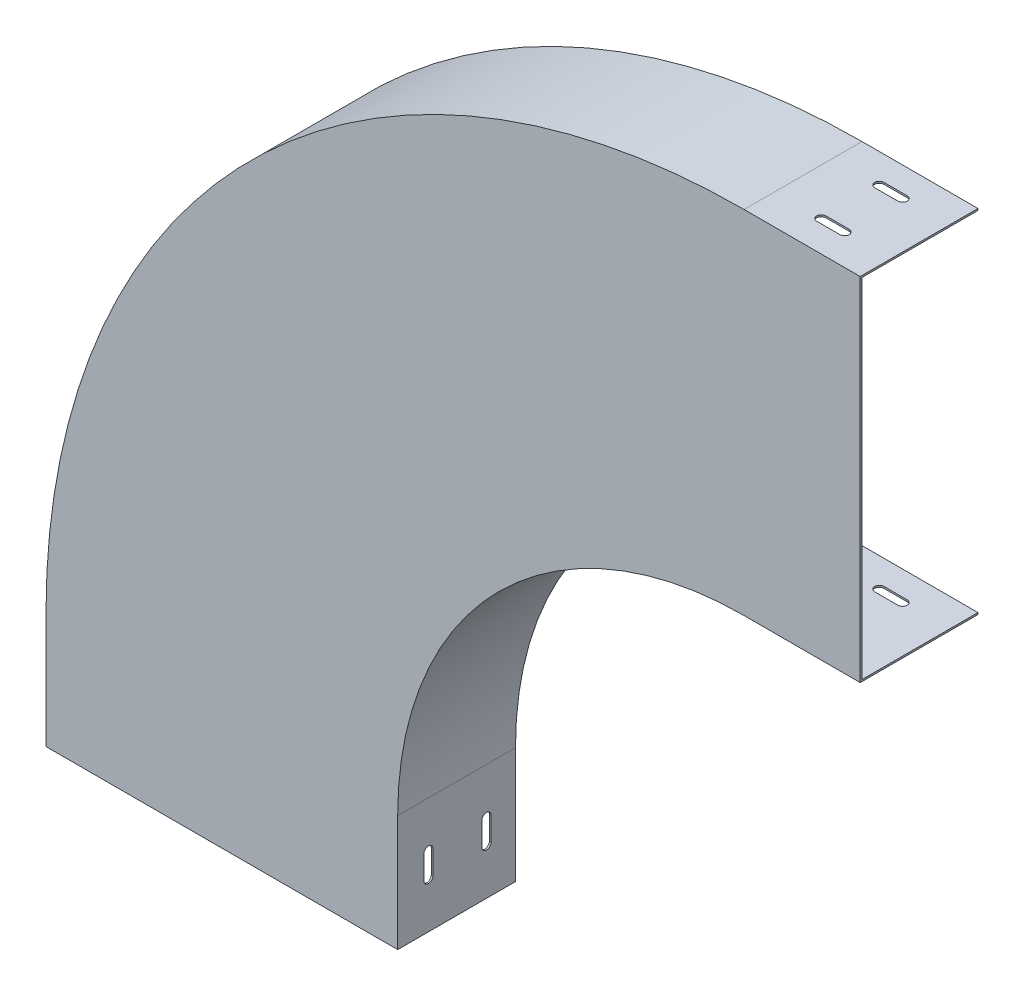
ISO-10303-21;
HEADER;
FILE_DESCRIPTION(('STEP AP214'),'2;1');
FILE_NAME('part.step','',(''),(''),'','','');
FILE_SCHEMA(('AUTOMOTIVE_DESIGN { 1 0 10303 214 1 1 1 1 }'));
ENDSEC;
DATA;
#1=APPLICATION_CONTEXT('core data for automotive mechanical design processes');
#2=APPLICATION_PROTOCOL_DEFINITION('international standard','automotive_design',2000,#1);
#3=PRODUCT_CONTEXT('',#1,'mechanical');
#4=PRODUCT('Part','Part','',(#3));
#5=PRODUCT_RELATED_PRODUCT_CATEGORY('part','',(#4));
#6=PRODUCT_DEFINITION_FORMATION('','',#4);
#7=PRODUCT_DEFINITION_CONTEXT('part definition',#1,'design');
#8=PRODUCT_DEFINITION('design','',#6,#7);
#9=PRODUCT_DEFINITION_SHAPE('','',#8);
#10=(LENGTH_UNIT() NAMED_UNIT(*) SI_UNIT(.MILLI.,.METRE.));
#11=(NAMED_UNIT(*) PLANE_ANGLE_UNIT() SI_UNIT($,.RADIAN.));
#12=(NAMED_UNIT(*) SI_UNIT($,.STERADIAN.) SOLID_ANGLE_UNIT());
#13=UNCERTAINTY_MEASURE_WITH_UNIT(LENGTH_MEASURE(1.E-05),#10,'distance_accuracy_value','');
#14=(GEOMETRIC_REPRESENTATION_CONTEXT(3) GLOBAL_UNCERTAINTY_ASSIGNED_CONTEXT((#13)) GLOBAL_UNIT_ASSIGNED_CONTEXT((#10,
#11,#12)) REPRESENTATION_CONTEXT('',''));
#15=CARTESIAN_POINT('',(0.,0.,0.));
#16=DIRECTION('',(0.,0.,1.));
#17=DIRECTION('',(1.,0.,0.));
#18=AXIS2_PLACEMENT_3D('',#15,#16,#17);
#19=CARTESIAN_POINT('',(450.000000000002,150.,1.08418380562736E-12));
#20=DIRECTION('',(0.,-1.,0.));
#21=DIRECTION('',(0.,0.,-1.));
#22=AXIS2_PLACEMENT_3D('',#19,#20,#21);
#23=PLANE('',#22);
#24=CARTESIAN_POINT('',(510.000000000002,150.,-25.));
#25=DIRECTION('',(0.,-1.,0.));
#26=DIRECTION('',(0.,0.,-1.));
#27=AXIS2_PLACEMENT_3D('',#24,#25,#26);
#28=CIRCLE('',#27,4.);
#29=CARTESIAN_POINT('',(510.000000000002,150.,-29.));
#30=VERTEX_POINT('',#29);
#31=CARTESIAN_POINT('',(510.000000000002,150.,-21.));
#32=VERTEX_POINT('',#31);
#33=EDGE_CURVE('E341',#30,#32,#28,.T.);
#34=ORIENTED_EDGE('',*,*,#33,.F.);
#35=DIRECTION('',(1.,0.,0.));
#36=VECTOR('',#35,1.);
#37=CARTESIAN_POINT('',(450.000000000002,150.,-29.));
#38=LINE('',#37,#36);
#39=CARTESIAN_POINT('',(490.000000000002,150.,-29.));
#40=VERTEX_POINT('',#39);
#41=EDGE_CURVE('E378',#40,#30,#38,.T.);
#42=ORIENTED_EDGE('',*,*,#41,.F.);
#43=CARTESIAN_POINT('',(490.000000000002,150.,-25.));
#44=DIRECTION('',(0.,-1.,0.));
#45=DIRECTION('',(0.,0.,-1.));
#46=AXIS2_PLACEMENT_3D('',#43,#44,#45);
#47=CIRCLE('',#46,4.);
#48=CARTESIAN_POINT('',(490.000000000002,150.,-21.));
#49=VERTEX_POINT('',#48);
#50=EDGE_CURVE('E374',#49,#40,#47,.T.);
#51=ORIENTED_EDGE('',*,*,#50,.F.);
#52=DIRECTION('',(-1.,0.,0.));
#53=VECTOR('',#52,1.);
#54=CARTESIAN_POINT('',(450.000000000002,150.,-21.));
#55=LINE('',#54,#53);
#56=EDGE_CURVE('E370',#32,#49,#55,.T.);
#57=ORIENTED_EDGE('',*,*,#56,.F.);
#58=EDGE_LOOP('',(#34,#42,#51,#57));
#59=FACE_BOUND('',#58,.T.);
#60=CARTESIAN_POINT('',(510.000000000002,150.000000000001,-75.));
#61=DIRECTION('',(0.,-1.,0.));
#62=DIRECTION('',(0.,0.,-1.));
#63=AXIS2_PLACEMENT_3D('',#60,#61,#62);
#64=CIRCLE('',#63,4.);
#65=CARTESIAN_POINT('',(510.000000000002,150.000000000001,-79.));
#66=VERTEX_POINT('',#65);
#67=CARTESIAN_POINT('',(510.000000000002,150.,-71.));
#68=VERTEX_POINT('',#67);
#69=EDGE_CURVE('E426',#66,#68,#64,.T.);
#70=ORIENTED_EDGE('',*,*,#69,.F.);
#71=DIRECTION('',(1.,0.,0.));
#72=VECTOR('',#71,1.);
#73=CARTESIAN_POINT('',(450.000000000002,150.000000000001,-79.));
#74=LINE('',#73,#72);
#75=CARTESIAN_POINT('',(490.000000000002,150.000000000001,-79.));
#76=VERTEX_POINT('',#75);
#77=EDGE_CURVE('E421',#76,#66,#74,.T.);
#78=ORIENTED_EDGE('',*,*,#77,.F.);
#79=CARTESIAN_POINT('',(490.000000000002,150.000000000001,-75.));
#80=DIRECTION('',(0.,-1.,0.));
#81=DIRECTION('',(0.,0.,-1.));
#82=AXIS2_PLACEMENT_3D('',#79,#80,#81);
#83=CIRCLE('',#82,4.);
#84=CARTESIAN_POINT('',(490.000000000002,150.,-71.));
#85=VERTEX_POINT('',#84);
#86=EDGE_CURVE('E417',#85,#76,#83,.T.);
#87=ORIENTED_EDGE('',*,*,#86,.F.);
#88=DIRECTION('',(-1.,0.,0.));
#89=VECTOR('',#88,1.);
#90=CARTESIAN_POINT('',(450.000000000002,150.,-71.));
#91=LINE('',#90,#89);
#92=EDGE_CURVE('E413',#68,#85,#91,.T.);
#93=ORIENTED_EDGE('',*,*,#92,.F.);
#94=EDGE_LOOP('',(#70,#78,#87,#93));
#95=FACE_BOUND('',#94,.T.);
#96=DIRECTION('',(0.,0.,-1.));
#97=VECTOR('',#96,1.);
#98=CARTESIAN_POINT('',(450.000000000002,150.,1.08418380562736E-12));
#99=LINE('',#98,#97);
#100=CARTESIAN_POINT('',(450.000000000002,150.,1.08418380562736E-12));
#101=VERTEX_POINT('',#100);
#102=CARTESIAN_POINT('',(450.000000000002,150.000000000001,-99.9999999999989));
#103=VERTEX_POINT('',#102);
#104=EDGE_CURVE('E593',#101,#103,#99,.T.);
#105=ORIENTED_EDGE('',*,*,#104,.T.);
#106=DIRECTION('',(1.,0.,0.));
#107=VECTOR('',#106,1.);
#108=CARTESIAN_POINT('',(450.000000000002,150.000000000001,-99.9999999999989));
#109=LINE('',#108,#107);
#110=CARTESIAN_POINT('',(550.000000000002,150.000000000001,-99.9999999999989));
#111=VERTEX_POINT('',#110);
#112=EDGE_CURVE('E659',#103,#111,#109,.T.);
#113=ORIENTED_EDGE('',*,*,#112,.T.);
#114=DIRECTION('',(0.,0.,-1.));
#115=VECTOR('',#114,1.);
#116=CARTESIAN_POINT('',(550.000000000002,150.,1.08418380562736E-12));
#117=LINE('',#116,#115);
#118=CARTESIAN_POINT('',(550.000000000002,150.,1.08418380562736E-12));
#119=VERTEX_POINT('',#118);
#120=EDGE_CURVE('E638',#119,#111,#117,.T.);
#121=ORIENTED_EDGE('',*,*,#120,.F.);
#122=DIRECTION('',(1.,0.,0.));
#123=VECTOR('',#122,1.);
#124=CARTESIAN_POINT('',(450.000000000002,150.,1.08418380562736E-12));
#125=LINE('',#124,#123);
#126=EDGE_CURVE('E662',#101,#119,#125,.T.);
#127=ORIENTED_EDGE('',*,*,#126,.F.);
#128=EDGE_LOOP('',(#105,#113,#121,#127));
#129=FACE_BOUND('',#128,.T.);
#130=ADVANCED_FACE('F32',(#59,#95,#129),#23,.T.);
#131=CARTESIAN_POINT('',(450.000000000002,151.5,1.5000000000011));
#132=DIRECTION('',(0.,1.,0.));
#133=DIRECTION('',(0.,0.,1.));
#134=AXIS2_PLACEMENT_3D('',#131,#132,#133);
#135=PLANE('',#134);
#136=CARTESIAN_POINT('',(510.000000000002,151.500000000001,-25.));
#137=DIRECTION('',(0.,-1.,0.));
#138=DIRECTION('',(0.,0.,-1.));
#139=AXIS2_PLACEMENT_3D('',#136,#137,#138);
#140=CIRCLE('',#139,4.);
#141=CARTESIAN_POINT('',(510.000000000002,151.500000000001,-29.));
#142=VERTEX_POINT('',#141);
#143=CARTESIAN_POINT('',(510.000000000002,151.500000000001,-21.));
#144=VERTEX_POINT('',#143);
#145=EDGE_CURVE('E338',#142,#144,#140,.T.);
#146=ORIENTED_EDGE('',*,*,#145,.T.);
#147=DIRECTION('',(-1.,0.,0.));
#148=VECTOR('',#147,1.);
#149=CARTESIAN_POINT('',(510.000000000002,151.500000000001,-21.));
#150=LINE('',#149,#148);
#151=CARTESIAN_POINT('',(490.000000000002,151.5,-21.));
#152=VERTEX_POINT('',#151);
#153=EDGE_CURVE('E347',#144,#152,#150,.T.);
#154=ORIENTED_EDGE('',*,*,#153,.T.);
#155=CARTESIAN_POINT('',(490.000000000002,151.500000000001,-25.));
#156=DIRECTION('',(0.,-1.,0.));
#157=DIRECTION('',(0.,0.,-1.));
#158=AXIS2_PLACEMENT_3D('',#155,#156,#157);
#159=CIRCLE('',#158,4.);
#160=CARTESIAN_POINT('',(490.000000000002,151.500000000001,-29.));
#161=VERTEX_POINT('',#160);
#162=EDGE_CURVE('E54',#152,#161,#159,.T.);
#163=ORIENTED_EDGE('',*,*,#162,.T.);
#164=DIRECTION('',(1.,0.,0.));
#165=VECTOR('',#164,1.);
#166=CARTESIAN_POINT('',(510.000000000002,151.500000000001,-29.));
#167=LINE('',#166,#165);
#168=EDGE_CURVE('E355',#161,#142,#167,.T.);
#169=ORIENTED_EDGE('',*,*,#168,.T.);
#170=EDGE_LOOP('',(#146,#154,#163,#169));
#171=FACE_BOUND('',#170,.T.);
#172=CARTESIAN_POINT('',(510.000000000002,151.500000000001,-75.));
#173=DIRECTION('',(0.,-1.,0.));
#174=DIRECTION('',(0.,0.,-1.));
#175=AXIS2_PLACEMENT_3D('',#172,#173,#174);
#176=CIRCLE('',#175,4.);
#177=CARTESIAN_POINT('',(510.000000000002,151.500000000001,-79.));
#178=VERTEX_POINT('',#177);
#179=CARTESIAN_POINT('',(510.000000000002,151.500000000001,-71.));
#180=VERTEX_POINT('',#179);
#181=EDGE_CURVE('E384',#178,#180,#176,.T.);
#182=ORIENTED_EDGE('',*,*,#181,.T.);
#183=DIRECTION('',(-1.,0.,0.));
#184=VECTOR('',#183,1.);
#185=CARTESIAN_POINT('',(510.000000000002,151.500000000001,-71.));
#186=LINE('',#185,#184);
#187=CARTESIAN_POINT('',(490.000000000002,151.5,-71.));
#188=VERTEX_POINT('',#187);
#189=EDGE_CURVE('E387',#180,#188,#186,.T.);
#190=ORIENTED_EDGE('',*,*,#189,.T.);
#191=CARTESIAN_POINT('',(490.000000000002,151.500000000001,-75.));
#192=DIRECTION('',(0.,-1.,0.));
#193=DIRECTION('',(0.,0.,-1.));
#194=AXIS2_PLACEMENT_3D('',#191,#192,#193);
#195=CIRCLE('',#194,4.);
#196=CARTESIAN_POINT('',(490.000000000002,151.500000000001,-79.));
#197=VERTEX_POINT('',#196);
#198=EDGE_CURVE('E390',#188,#197,#195,.T.);
#199=ORIENTED_EDGE('',*,*,#198,.T.);
#200=DIRECTION('',(1.,0.,0.));
#201=VECTOR('',#200,1.);
#202=CARTESIAN_POINT('',(510.000000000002,151.500000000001,-79.));
#203=LINE('',#202,#201);
#204=EDGE_CURVE('E393',#197,#178,#203,.T.);
#205=ORIENTED_EDGE('',*,*,#204,.T.);
#206=EDGE_LOOP('',(#182,#190,#199,#205));
#207=FACE_BOUND('',#206,.T.);
#208=DIRECTION('',(0.,0.,1.));
#209=VECTOR('',#208,1.);
#210=CARTESIAN_POINT('',(450.000000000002,151.5,1.5000000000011));
#211=LINE('',#210,#209);
#212=CARTESIAN_POINT('',(450.000000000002,151.500000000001,-99.9999999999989));
#213=VERTEX_POINT('',#212);
#214=CARTESIAN_POINT('',(450.000000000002,151.5,1.5000000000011));
#215=VERTEX_POINT('',#214);
#216=EDGE_CURVE('E590',#213,#215,#211,.T.);
#217=ORIENTED_EDGE('',*,*,#216,.T.);
#218=DIRECTION('',(1.,0.,0.));
#219=VECTOR('',#218,1.);
#220=CARTESIAN_POINT('',(450.000000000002,151.5,1.5000000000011));
#221=LINE('',#220,#219);
#222=CARTESIAN_POINT('',(550.000000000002,151.5,1.5000000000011));
#223=VERTEX_POINT('',#222);
#224=EDGE_CURVE('E653',#215,#223,#221,.T.);
#225=ORIENTED_EDGE('',*,*,#224,.T.);
#226=DIRECTION('',(0.,0.,1.));
#227=VECTOR('',#226,1.);
#228=CARTESIAN_POINT('',(550.000000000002,151.5,1.5000000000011));
#229=LINE('',#228,#227);
#230=CARTESIAN_POINT('',(550.000000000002,151.500000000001,-99.9999999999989));
#231=VERTEX_POINT('',#230);
#232=EDGE_CURVE('E632',#231,#223,#229,.T.);
#233=ORIENTED_EDGE('',*,*,#232,.F.);
#234=DIRECTION('',(1.,0.,0.));
#235=VECTOR('',#234,1.);
#236=CARTESIAN_POINT('',(450.000000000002,151.500000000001,-99.9999999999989));
#237=LINE('',#236,#235);
#238=EDGE_CURVE('E656',#213,#231,#237,.T.);
#239=ORIENTED_EDGE('',*,*,#238,.F.);
#240=EDGE_LOOP('',(#217,#225,#233,#239));
#241=FACE_BOUND('',#240,.T.);
#242=ADVANCED_FACE('F352',(#171,#207,#241),#135,.T.);
#243=CARTESIAN_POINT('',(450.000000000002,-151.5,1.4999999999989));
#244=DIRECTION('',(0.,-1.,0.));
#245=DIRECTION('',(0.,0.,-1.));
#246=AXIS2_PLACEMENT_3D('',#243,#244,#245);
#247=PLANE('',#246);
#248=CARTESIAN_POINT('',(510.000000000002,-151.5,-25.));
#249=DIRECTION('',(0.,-1.,0.));
#250=DIRECTION('',(0.,0.,-1.));
#251=AXIS2_PLACEMENT_3D('',#248,#249,#250);
#252=CIRCLE('',#251,4.);
#253=CARTESIAN_POINT('',(510.000000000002,-151.5,-29.));
#254=VERTEX_POINT('',#253);
#255=CARTESIAN_POINT('',(510.000000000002,-151.5,-21.));
#256=VERTEX_POINT('',#255);
#257=EDGE_CURVE('E380',#254,#256,#252,.T.);
#258=ORIENTED_EDGE('',*,*,#257,.F.);
#259=DIRECTION('',(1.,0.,0.));
#260=VECTOR('',#259,1.);
#261=CARTESIAN_POINT('',(450.000000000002,-151.5,-29.));
#262=LINE('',#261,#260);
#263=CARTESIAN_POINT('',(490.000000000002,-151.5,-29.));
#264=VERTEX_POINT('',#263);
#265=EDGE_CURVE('E376',#264,#254,#262,.T.);
#266=ORIENTED_EDGE('',*,*,#265,.F.);
#267=CARTESIAN_POINT('',(490.000000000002,-151.5,-25.));
#268=DIRECTION('',(0.,-1.,0.));
#269=DIRECTION('',(0.,0.,-1.));
#270=AXIS2_PLACEMENT_3D('',#267,#268,#269);
#271=CIRCLE('',#270,4.);
#272=CARTESIAN_POINT('',(490.000000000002,-151.5,-21.));
#273=VERTEX_POINT('',#272);
#274=EDGE_CURVE('E372',#273,#264,#271,.T.);
#275=ORIENTED_EDGE('',*,*,#274,.F.);
#276=DIRECTION('',(-1.,0.,0.));
#277=VECTOR('',#276,1.);
#278=CARTESIAN_POINT('',(450.000000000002,-151.5,-21.));
#279=LINE('',#278,#277);
#280=EDGE_CURVE('E362',#256,#273,#279,.T.);
#281=ORIENTED_EDGE('',*,*,#280,.F.);
#282=EDGE_LOOP('',(#258,#266,#275,#281));
#283=FACE_BOUND('',#282,.T.);
#284=CARTESIAN_POINT('',(510.000000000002,-151.499999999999,-75.));
#285=DIRECTION('',(0.,-1.,0.));
#286=DIRECTION('',(0.,0.,-1.));
#287=AXIS2_PLACEMENT_3D('',#284,#285,#286);
#288=CIRCLE('',#287,4.);
#289=CARTESIAN_POINT('',(510.000000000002,-151.499999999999,-79.));
#290=VERTEX_POINT('',#289);
#291=CARTESIAN_POINT('',(510.000000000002,-151.499999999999,-71.));
#292=VERTEX_POINT('',#291);
#293=EDGE_CURVE('E423',#290,#292,#288,.T.);
#294=ORIENTED_EDGE('',*,*,#293,.F.);
#295=DIRECTION('',(1.,0.,0.));
#296=VECTOR('',#295,1.);
#297=CARTESIAN_POINT('',(450.000000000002,-151.499999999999,-79.));
#298=LINE('',#297,#296);
#299=CARTESIAN_POINT('',(490.000000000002,-151.499999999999,-79.));
#300=VERTEX_POINT('',#299);
#301=EDGE_CURVE('E419',#300,#290,#298,.T.);
#302=ORIENTED_EDGE('',*,*,#301,.F.);
#303=CARTESIAN_POINT('',(490.000000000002,-151.499999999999,-75.));
#304=DIRECTION('',(0.,-1.,0.));
#305=DIRECTION('',(0.,0.,-1.));
#306=AXIS2_PLACEMENT_3D('',#303,#304,#305);
#307=CIRCLE('',#306,4.);
#308=CARTESIAN_POINT('',(490.000000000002,-151.5,-71.));
#309=VERTEX_POINT('',#308);
#310=EDGE_CURVE('E415',#309,#300,#307,.T.);
#311=ORIENTED_EDGE('',*,*,#310,.F.);
#312=DIRECTION('',(-1.,0.,0.));
#313=VECTOR('',#312,1.);
#314=CARTESIAN_POINT('',(450.000000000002,-151.499999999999,-71.));
#315=LINE('',#314,#313);
#316=EDGE_CURVE('E400',#292,#309,#315,.T.);
#317=ORIENTED_EDGE('',*,*,#316,.F.);
#318=EDGE_LOOP('',(#294,#302,#311,#317));
#319=FACE_BOUND('',#318,.T.);
#320=DIRECTION('',(0.,0.,-1.));
#321=VECTOR('',#320,1.);
#322=CARTESIAN_POINT('',(450.000000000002,-151.5,1.4999999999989));
#323=LINE('',#322,#321);
#324=CARTESIAN_POINT('',(450.000000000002,-151.5,1.4999999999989));
#325=VERTEX_POINT('',#324);
#326=CARTESIAN_POINT('',(450.000000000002,-151.499999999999,-100.000000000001));
#327=VERTEX_POINT('',#326);
#328=EDGE_CURVE('E587',#325,#327,#323,.T.);
#329=ORIENTED_EDGE('',*,*,#328,.T.);
#330=DIRECTION('',(1.,0.,0.));
#331=VECTOR('',#330,1.);
#332=CARTESIAN_POINT('',(450.000000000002,-151.499999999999,-100.000000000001));
#333=LINE('',#332,#331);
#334=CARTESIAN_POINT('',(550.000000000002,-151.499999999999,-100.000000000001));
#335=VERTEX_POINT('',#334);
#336=EDGE_CURVE('E647',#327,#335,#333,.T.);
#337=ORIENTED_EDGE('',*,*,#336,.T.);
#338=DIRECTION('',(0.,0.,-1.));
#339=VECTOR('',#338,1.);
#340=CARTESIAN_POINT('',(550.000000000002,-151.5,1.4999999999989));
#341=LINE('',#340,#339);
#342=CARTESIAN_POINT('',(550.000000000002,-151.5,1.4999999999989));
#343=VERTEX_POINT('',#342);
#344=EDGE_CURVE('E626',#343,#335,#341,.T.);
#345=ORIENTED_EDGE('',*,*,#344,.F.);
#346=DIRECTION('',(1.,0.,0.));
#347=VECTOR('',#346,1.);
#348=CARTESIAN_POINT('',(450.000000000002,-151.5,1.4999999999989));
#349=LINE('',#348,#347);
#350=EDGE_CURVE('E650',#325,#343,#349,.T.);
#351=ORIENTED_EDGE('',*,*,#350,.F.);
#352=EDGE_LOOP('',(#329,#337,#345,#351));
#353=FACE_BOUND('',#352,.T.);
#354=ADVANCED_FACE('F731',(#283,#319,#353),#247,.T.);
#355=CARTESIAN_POINT('',(450.000000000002,-150.,-1.13929291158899E-12));
#356=DIRECTION('',(0.,1.,0.));
#357=DIRECTION('',(0.,0.,1.));
#358=AXIS2_PLACEMENT_3D('',#355,#356,#357);
#359=PLANE('',#358);
#360=CARTESIAN_POINT('',(510.000000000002,-150.,-25.));
#361=DIRECTION('',(0.,1.,0.));
#362=DIRECTION('',(0.,0.,1.));
#363=AXIS2_PLACEMENT_3D('',#360,#361,#362);
#364=CIRCLE('',#363,4.);
#365=CARTESIAN_POINT('',(510.000000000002,-150.,-21.));
#366=VERTEX_POINT('',#365);
#367=CARTESIAN_POINT('',(510.000000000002,-150.,-29.));
#368=VERTEX_POINT('',#367);
#369=EDGE_CURVE('E11',#366,#368,#364,.T.);
#370=ORIENTED_EDGE('',*,*,#369,.F.);
#371=DIRECTION('',(1.,0.,0.));
#372=VECTOR('',#371,1.);
#373=CARTESIAN_POINT('',(450.000000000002,-150.,-21.));
#374=LINE('',#373,#372);
#375=CARTESIAN_POINT('',(490.000000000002,-150.,-21.));
#376=VERTEX_POINT('',#375);
#377=EDGE_CURVE('E701',#376,#366,#374,.T.);
#378=ORIENTED_EDGE('',*,*,#377,.F.);
#379=CARTESIAN_POINT('',(490.000000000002,-150.,-25.));
#380=DIRECTION('',(0.,1.,0.));
#381=DIRECTION('',(0.,0.,1.));
#382=AXIS2_PLACEMENT_3D('',#379,#380,#381);
#383=CIRCLE('',#382,4.);
#384=CARTESIAN_POINT('',(490.000000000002,-150.,-29.));
#385=VERTEX_POINT('',#384);
#386=EDGE_CURVE('E703',#385,#376,#383,.T.);
#387=ORIENTED_EDGE('',*,*,#386,.F.);
#388=DIRECTION('',(-1.,0.,0.));
#389=VECTOR('',#388,1.);
#390=CARTESIAN_POINT('',(450.000000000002,-150.,-29.));
#391=LINE('',#390,#389);
#392=EDGE_CURVE('E39',#368,#385,#391,.T.);
#393=ORIENTED_EDGE('',*,*,#392,.F.);
#394=EDGE_LOOP('',(#370,#378,#387,#393));
#395=FACE_BOUND('',#394,.T.);
#396=CARTESIAN_POINT('',(510.000000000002,-149.999999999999,-75.));
#397=DIRECTION('',(0.,1.,0.));
#398=DIRECTION('',(0.,0.,1.));
#399=AXIS2_PLACEMENT_3D('',#396,#397,#398);
#400=CIRCLE('',#399,4.);
#401=CARTESIAN_POINT('',(510.000000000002,-149.999999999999,-71.));
#402=VERTEX_POINT('',#401);
#403=CARTESIAN_POINT('',(510.000000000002,-149.999999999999,-79.));
#404=VERTEX_POINT('',#403);
#405=EDGE_CURVE('E699',#402,#404,#400,.T.);
#406=ORIENTED_EDGE('',*,*,#405,.F.);
#407=DIRECTION('',(1.,0.,0.));
#408=VECTOR('',#407,1.);
#409=CARTESIAN_POINT('',(450.000000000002,-149.999999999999,-71.));
#410=LINE('',#409,#408);
#411=CARTESIAN_POINT('',(490.000000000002,-149.999999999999,-71.));
#412=VERTEX_POINT('',#411);
#413=EDGE_CURVE('E692',#412,#402,#410,.T.);
#414=ORIENTED_EDGE('',*,*,#413,.F.);
#415=CARTESIAN_POINT('',(490.000000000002,-149.999999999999,-75.));
#416=DIRECTION('',(0.,1.,0.));
#417=DIRECTION('',(0.,0.,1.));
#418=AXIS2_PLACEMENT_3D('',#415,#416,#417);
#419=CIRCLE('',#418,4.);
#420=CARTESIAN_POINT('',(490.000000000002,-149.999999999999,-79.));
#421=VERTEX_POINT('',#420);
#422=EDGE_CURVE('E694',#421,#412,#419,.T.);
#423=ORIENTED_EDGE('',*,*,#422,.F.);
#424=DIRECTION('',(-1.,0.,0.));
#425=VECTOR('',#424,1.);
#426=CARTESIAN_POINT('',(450.000000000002,-149.999999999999,-79.));
#427=LINE('',#426,#425);
#428=EDGE_CURVE('E697',#404,#421,#427,.T.);
#429=ORIENTED_EDGE('',*,*,#428,.F.);
#430=EDGE_LOOP('',(#406,#414,#423,#429));
#431=FACE_BOUND('',#430,.T.);
#432=DIRECTION('',(0.,0.,1.));
#433=VECTOR('',#432,1.);
#434=CARTESIAN_POINT('',(450.000000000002,-150.,-1.13929291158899E-12));
#435=LINE('',#434,#433);
#436=CARTESIAN_POINT('',(450.000000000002,-149.999999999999,-100.000000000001));
#437=VERTEX_POINT('',#436);
#438=CARTESIAN_POINT('',(450.000000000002,-150.,-1.13929291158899E-12));
#439=VERTEX_POINT('',#438);
#440=EDGE_CURVE('E584',#437,#439,#435,.T.);
#441=ORIENTED_EDGE('',*,*,#440,.T.);
#442=DIRECTION('',(1.,0.,0.));
#443=VECTOR('',#442,1.);
#444=CARTESIAN_POINT('',(450.000000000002,-150.,-1.13929291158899E-12));
#445=LINE('',#444,#443);
#446=CARTESIAN_POINT('',(550.000000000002,-150.,-1.13929291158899E-12));
#447=VERTEX_POINT('',#446);
#448=EDGE_CURVE('E665',#439,#447,#445,.T.);
#449=ORIENTED_EDGE('',*,*,#448,.T.);
#450=DIRECTION('',(0.,0.,1.));
#451=VECTOR('',#450,1.);
#452=CARTESIAN_POINT('',(550.000000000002,-150.,-1.13929291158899E-12));
#453=LINE('',#452,#451);
#454=CARTESIAN_POINT('',(550.000000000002,-149.999999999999,-100.000000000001));
#455=VERTEX_POINT('',#454);
#456=EDGE_CURVE('E620',#455,#447,#453,.T.);
#457=ORIENTED_EDGE('',*,*,#456,.F.);
#458=DIRECTION('',(1.,0.,0.));
#459=VECTOR('',#458,1.);
#460=CARTESIAN_POINT('',(450.000000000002,-149.999999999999,-100.000000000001));
#461=LINE('',#460,#459);
#462=EDGE_CURVE('E644',#437,#455,#461,.T.);
#463=ORIENTED_EDGE('',*,*,#462,.F.);
#464=EDGE_LOOP('',(#441,#449,#457,#463));
#465=FACE_BOUND('',#464,.T.);
#466=ADVANCED_FACE('F721',(#395,#431,#465),#359,.T.);
#467=CARTESIAN_POINT('',(450.000000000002,-450.,0.));
#468=DIRECTION('',(0.,0.,-1.));
#469=DIRECTION('',(-1.,0.,0.));
#470=AXIS2_PLACEMENT_3D('',#467,#468,#469);
#471=CYLINDRICAL_SURFACE('',#470,600.);
#472=DIRECTION('',(0.,0.,-1.));
#473=VECTOR('',#472,1.);
#474=CARTESIAN_POINT('',(-149.999999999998,-450.000000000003,1.08418380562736E-12));
#475=LINE('',#474,#473);
#476=CARTESIAN_POINT('',(-149.999999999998,-450.000000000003,1.08418380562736E-12));
#477=VERTEX_POINT('',#476);
#478=CARTESIAN_POINT('',(-149.999999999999,-450.000000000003,-99.9999999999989));
#479=VERTEX_POINT('',#478);
#480=EDGE_CURVE('E535',#477,#479,#475,.T.);
#481=ORIENTED_EDGE('',*,*,#480,.T.);
#482=CARTESIAN_POINT('',(450.000000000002,-450.,-99.9999999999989));
#483=DIRECTION('',(0.,0.,-1.));
#484=DIRECTION('',(-1.,0.,0.));
#485=AXIS2_PLACEMENT_3D('',#482,#483,#484);
#486=CIRCLE('',#485,600.000000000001);
#487=EDGE_CURVE('E611',#479,#103,#486,.T.);
#488=ORIENTED_EDGE('',*,*,#487,.T.);
#489=ORIENTED_EDGE('',*,*,#104,.F.);
#490=CARTESIAN_POINT('',(450.000000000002,-450.,1.08418380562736E-12));
#491=DIRECTION('',(0.,0.,-1.));
#492=DIRECTION('',(-1.,0.,0.));
#493=AXIS2_PLACEMENT_3D('',#490,#491,#492);
#494=CIRCLE('',#493,600.);
#495=EDGE_CURVE('E614',#477,#101,#494,.T.);
#496=ORIENTED_EDGE('',*,*,#495,.F.);
#497=EDGE_LOOP('',(#481,#488,#489,#496));
#498=FACE_BOUND('',#497,.T.);
#499=ADVANCED_FACE('F775',(#498),#471,.F.);
#500=CARTESIAN_POINT('',(450.000000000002,-450.,0.));
#501=DIRECTION('',(0.,0.,-1.));
#502=DIRECTION('',(-1.,0.,0.));
#503=AXIS2_PLACEMENT_3D('',#500,#501,#502);
#504=CYLINDRICAL_SURFACE('',#503,601.5);
#505=DIRECTION('',(0.,0.,1.));
#506=VECTOR('',#505,1.);
#507=CARTESIAN_POINT('',(-151.499999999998,-450.000000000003,1.5000000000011));
#508=LINE('',#507,#506);
#509=CARTESIAN_POINT('',(-151.499999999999,-450.000000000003,-99.9999999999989));
#510=VERTEX_POINT('',#509);
#511=CARTESIAN_POINT('',(-151.499999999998,-450.000000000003,1.5000000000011));
#512=VERTEX_POINT('',#511);
#513=EDGE_CURVE('E539',#510,#512,#508,.T.);
#514=ORIENTED_EDGE('',*,*,#513,.T.);
#515=CARTESIAN_POINT('',(450.000000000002,-450.,1.5000000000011));
#516=DIRECTION('',(0.,0.,-1.));
#517=DIRECTION('',(-1.,0.,0.));
#518=AXIS2_PLACEMENT_3D('',#515,#516,#517);
#519=CIRCLE('',#518,601.5);
#520=EDGE_CURVE('E605',#512,#215,#519,.T.);
#521=ORIENTED_EDGE('',*,*,#520,.T.);
#522=ORIENTED_EDGE('',*,*,#216,.F.);
#523=CARTESIAN_POINT('',(450.000000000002,-450.,-99.9999999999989));
#524=DIRECTION('',(0.,0.,-1.));
#525=DIRECTION('',(-1.,0.,0.));
#526=AXIS2_PLACEMENT_3D('',#523,#524,#525);
#527=CIRCLE('',#526,601.500000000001);
#528=EDGE_CURVE('E608',#510,#213,#527,.T.);
#529=ORIENTED_EDGE('',*,*,#528,.F.);
#530=EDGE_LOOP('',(#514,#521,#522,#529));
#531=FACE_BOUND('',#530,.T.);
#532=ADVANCED_FACE('F785',(#531),#504,.T.);
#533=CARTESIAN_POINT('',(450.000000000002,-450.,0.));
#534=DIRECTION('',(0.,0.,-1.));
#535=DIRECTION('',(-1.,0.,0.));
#536=AXIS2_PLACEMENT_3D('',#533,#534,#535);
#537=CYLINDRICAL_SURFACE('',#536,298.5);
#538=DIRECTION('',(0.,0.,-1.));
#539=VECTOR('',#538,1.);
#540=CARTESIAN_POINT('',(151.500000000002,-450.000000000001,1.4999999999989));
#541=LINE('',#540,#539);
#542=CARTESIAN_POINT('',(151.500000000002,-450.000000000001,1.4999999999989));
#543=VERTEX_POINT('',#542);
#544=CARTESIAN_POINT('',(151.500000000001,-450.000000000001,-100.000000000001));
#545=VERTEX_POINT('',#544);
#546=EDGE_CURVE('E542',#543,#545,#541,.T.);
#547=ORIENTED_EDGE('',*,*,#546,.T.);
#548=CARTESIAN_POINT('',(450.000000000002,-450.,-100.000000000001));
#549=DIRECTION('',(0.,0.,-1.));
#550=DIRECTION('',(-1.,0.,0.));
#551=AXIS2_PLACEMENT_3D('',#548,#549,#550);
#552=CIRCLE('',#551,298.500000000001);
#553=EDGE_CURVE('E599',#545,#327,#552,.T.);
#554=ORIENTED_EDGE('',*,*,#553,.T.);
#555=ORIENTED_EDGE('',*,*,#328,.F.);
#556=CARTESIAN_POINT('',(450.000000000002,-450.,1.4999999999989));
#557=DIRECTION('',(0.,0.,-1.));
#558=DIRECTION('',(-1.,0.,0.));
#559=AXIS2_PLACEMENT_3D('',#556,#557,#558);
#560=CIRCLE('',#559,298.5);
#561=EDGE_CURVE('E602',#543,#325,#560,.T.);
#562=ORIENTED_EDGE('',*,*,#561,.F.);
#563=EDGE_LOOP('',(#547,#554,#555,#562));
#564=FACE_BOUND('',#563,.T.);
#565=ADVANCED_FACE('F741',(#564),#537,.F.);
#566=CARTESIAN_POINT('',(450.000000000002,-450.,0.));
#567=DIRECTION('',(0.,0.,-1.));
#568=DIRECTION('',(-1.,0.,0.));
#569=AXIS2_PLACEMENT_3D('',#566,#567,#568);
#570=CYLINDRICAL_SURFACE('',#569,300.);
#571=DIRECTION('',(0.,0.,1.));
#572=VECTOR('',#571,1.);
#573=CARTESIAN_POINT('',(150.000000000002,-450.000000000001,-1.13929291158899E-12));
#574=LINE('',#573,#572);
#575=CARTESIAN_POINT('',(150.000000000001,-450.000000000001,-100.000000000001));
#576=VERTEX_POINT('',#575);
#577=CARTESIAN_POINT('',(150.000000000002,-450.000000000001,-1.13929291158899E-12));
#578=VERTEX_POINT('',#577);
#579=EDGE_CURVE('E532',#576,#578,#574,.T.);
#580=ORIENTED_EDGE('',*,*,#579,.T.);
#581=CARTESIAN_POINT('',(450.000000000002,-450.,-1.13929291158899E-12));
#582=DIRECTION('',(0.,0.,-1.));
#583=DIRECTION('',(-1.,0.,0.));
#584=AXIS2_PLACEMENT_3D('',#581,#582,#583);
#585=CIRCLE('',#584,300.);
#586=EDGE_CURVE('E617',#578,#439,#585,.T.);
#587=ORIENTED_EDGE('',*,*,#586,.T.);
#588=ORIENTED_EDGE('',*,*,#440,.F.);
#589=CARTESIAN_POINT('',(450.000000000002,-450.,-100.000000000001));
#590=DIRECTION('',(0.,0.,-1.));
#591=DIRECTION('',(-1.,0.,0.));
#592=AXIS2_PLACEMENT_3D('',#589,#590,#591);
#593=CIRCLE('',#592,300.000000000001);
#594=EDGE_CURVE('E596',#576,#437,#593,.T.);
#595=ORIENTED_EDGE('',*,*,#594,.F.);
#596=EDGE_LOOP('',(#580,#587,#588,#595));
#597=FACE_BOUND('',#596,.T.);
#598=ADVANCED_FACE('F766',(#597),#570,.T.);
#599=CARTESIAN_POINT('',(150.000000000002,-450.000000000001,-1.13929291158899E-12));
#600=DIRECTION('',(1.,0.,0.));
#601=DIRECTION('',(0.,0.,-1.));
#602=AXIS2_PLACEMENT_3D('',#599,#600,#601);
#603=PLANE('',#602);
#604=DIRECTION('',(0.,-1.,0.));
#605=VECTOR('',#604,1.);
#606=CARTESIAN_POINT('',(150.000000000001,-450.000000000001,-71.));
#607=LINE('',#606,#605);
#608=CARTESIAN_POINT('',(150.000000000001,-490.000000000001,-71.));
#609=VERTEX_POINT('',#608);
#610=CARTESIAN_POINT('',(150.000000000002,-510.000000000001,-71.));
#611=VERTEX_POINT('',#610);
#612=EDGE_CURVE('E471',#609,#611,#607,.T.);
#613=ORIENTED_EDGE('',*,*,#612,.T.);
#614=CARTESIAN_POINT('',(150.000000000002,-510.000000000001,-75.));
#615=DIRECTION('',(1.,0.,0.));
#616=DIRECTION('',(0.,0.,-1.));
#617=AXIS2_PLACEMENT_3D('',#614,#615,#616);
#618=CIRCLE('',#617,4.);
#619=CARTESIAN_POINT('',(150.000000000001,-510.000000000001,-79.));
#620=VERTEX_POINT('',#619);
#621=EDGE_CURVE('E477',#611,#620,#618,.T.);
#622=ORIENTED_EDGE('',*,*,#621,.T.);
#623=DIRECTION('',(0.,1.,0.));
#624=VECTOR('',#623,1.);
#625=CARTESIAN_POINT('',(150.000000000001,-450.000000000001,-79.));
#626=LINE('',#625,#624);
#627=CARTESIAN_POINT('',(150.000000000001,-490.,-79.));
#628=VERTEX_POINT('',#627);
#629=EDGE_CURVE('E459',#620,#628,#626,.T.);
#630=ORIENTED_EDGE('',*,*,#629,.T.);
#631=CARTESIAN_POINT('',(150.000000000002,-490.000000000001,-75.));
#632=DIRECTION('',(1.,0.,0.));
#633=DIRECTION('',(0.,0.,-1.));
#634=AXIS2_PLACEMENT_3D('',#631,#632,#633);
#635=CIRCLE('',#634,4.);
#636=EDGE_CURVE('E465',#628,#609,#635,.T.);
#637=ORIENTED_EDGE('',*,*,#636,.T.);
#638=EDGE_LOOP('',(#613,#622,#630,#637));
#639=FACE_BOUND('',#638,.T.);
#640=DIRECTION('',(0.,-1.,0.));
#641=VECTOR('',#640,1.);
#642=CARTESIAN_POINT('',(150.000000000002,-450.000000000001,-21.));
#643=LINE('',#642,#641);
#644=CARTESIAN_POINT('',(150.000000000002,-490.000000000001,-21.));
#645=VERTEX_POINT('',#644);
#646=CARTESIAN_POINT('',(150.000000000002,-510.000000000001,-21.));
#647=VERTEX_POINT('',#646);
#648=EDGE_CURVE('E522',#645,#647,#643,.T.);
#649=ORIENTED_EDGE('',*,*,#648,.T.);
#650=CARTESIAN_POINT('',(150.000000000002,-510.000000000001,-25.));
#651=DIRECTION('',(1.,0.,0.));
#652=DIRECTION('',(0.,0.,-1.));
#653=AXIS2_PLACEMENT_3D('',#650,#651,#652);
#654=CIRCLE('',#653,4.);
#655=CARTESIAN_POINT('',(150.000000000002,-510.000000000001,-29.));
#656=VERTEX_POINT('',#655);
#657=EDGE_CURVE('E528',#647,#656,#654,.T.);
#658=ORIENTED_EDGE('',*,*,#657,.T.);
#659=DIRECTION('',(0.,1.,0.));
#660=VECTOR('',#659,1.);
#661=CARTESIAN_POINT('',(150.000000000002,-450.000000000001,-29.));
#662=LINE('',#661,#660);
#663=CARTESIAN_POINT('',(150.000000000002,-490.,-29.));
#664=VERTEX_POINT('',#663);
#665=EDGE_CURVE('E510',#656,#664,#662,.T.);
#666=ORIENTED_EDGE('',*,*,#665,.T.);
#667=CARTESIAN_POINT('',(150.000000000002,-490.000000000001,-25.));
#668=DIRECTION('',(1.,0.,0.));
#669=DIRECTION('',(0.,0.,-1.));
#670=AXIS2_PLACEMENT_3D('',#667,#668,#669);
#671=CIRCLE('',#670,4.);
#672=EDGE_CURVE('E516',#664,#645,#671,.T.);
#673=ORIENTED_EDGE('',*,*,#672,.T.);
#674=EDGE_LOOP('',(#649,#658,#666,#673));
#675=FACE_BOUND('',#674,.T.);
#676=DIRECTION('',(0.,0.,1.));
#677=VECTOR('',#676,1.);
#678=CARTESIAN_POINT('',(150.000000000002,-550.000000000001,-1.13929291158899E-12));
#679=LINE('',#678,#677);
#680=CARTESIAN_POINT('',(150.000000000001,-550.000000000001,-100.000000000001));
#681=VERTEX_POINT('',#680);
#682=CARTESIAN_POINT('',(150.000000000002,-550.000000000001,-1.13929291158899E-12));
#683=VERTEX_POINT('',#682);
#684=EDGE_CURVE('E531',#681,#683,#679,.T.);
#685=ORIENTED_EDGE('',*,*,#684,.T.);
#686=DIRECTION('',(0.,-1.,0.));
#687=VECTOR('',#686,1.);
#688=CARTESIAN_POINT('',(150.000000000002,-450.000000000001,-1.13929291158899E-12));
#689=LINE('',#688,#687);
#690=EDGE_CURVE('E581',#578,#683,#689,.T.);
#691=ORIENTED_EDGE('',*,*,#690,.F.);
#692=ORIENTED_EDGE('',*,*,#579,.F.);
#693=DIRECTION('',(0.,-1.,0.));
#694=VECTOR('',#693,1.);
#695=CARTESIAN_POINT('',(150.000000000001,-450.000000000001,-100.000000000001));
#696=LINE('',#695,#694);
#697=EDGE_CURVE('E545',#576,#681,#696,.T.);
#698=ORIENTED_EDGE('',*,*,#697,.T.);
#699=EDGE_LOOP('',(#685,#691,#692,#698));
#700=FACE_BOUND('',#699,.T.);
#701=ADVANCED_FACE('F763',(#639,#675,#700),#603,.F.);
#702=CARTESIAN_POINT('',(150.000000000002,-450.000000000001,-1.13929291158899E-12));
#703=DIRECTION('',(0.,0.,1.));
#704=DIRECTION('',(1.,0.,0.));
#705=AXIS2_PLACEMENT_3D('',#702,#703,#704);
#706=PLANE('',#705);
#707=DIRECTION('',(-1.,0.,0.));
#708=VECTOR('',#707,1.);
#709=CARTESIAN_POINT('',(150.000000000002,-550.000000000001,-1.13929291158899E-12));
#710=LINE('',#709,#708);
#711=CARTESIAN_POINT('',(-149.999999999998,-550.000000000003,1.08418380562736E-12));
#712=VERTEX_POINT('',#711);
#713=EDGE_CURVE('E548',#683,#712,#710,.T.);
#714=ORIENTED_EDGE('',*,*,#713,.T.);
#715=DIRECTION('',(0.,-1.,0.));
#716=VECTOR('',#715,1.);
#717=CARTESIAN_POINT('',(-149.999999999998,-450.000000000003,1.08418380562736E-12));
#718=LINE('',#717,#716);
#719=EDGE_CURVE('E578',#477,#712,#718,.T.);
#720=ORIENTED_EDGE('',*,*,#719,.F.);
#721=ORIENTED_EDGE('',*,*,#495,.T.);
#722=ORIENTED_EDGE('',*,*,#126,.T.);
#723=DIRECTION('',(0.,1.,0.));
#724=VECTOR('',#723,1.);
#725=CARTESIAN_POINT('',(550.000000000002,-150.,-1.13929291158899E-12));
#726=LINE('',#725,#724);
#727=EDGE_CURVE('E641',#447,#119,#726,.T.);
#728=ORIENTED_EDGE('',*,*,#727,.F.);
#729=ORIENTED_EDGE('',*,*,#448,.F.);
#730=ORIENTED_EDGE('',*,*,#586,.F.);
#731=ORIENTED_EDGE('',*,*,#690,.T.);
#732=EDGE_LOOP('',(#714,#720,#721,#722,#728,#729,#730,#731));
#733=FACE_BOUND('',#732,.T.);
#734=ADVANCED_FACE('F770',(#733),#706,.F.);
#735=CARTESIAN_POINT('',(-149.999999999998,-450.000000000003,1.08418380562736E-12));
#736=DIRECTION('',(-1.,0.,0.));
#737=DIRECTION('',(0.,0.,1.));
#738=AXIS2_PLACEMENT_3D('',#735,#736,#737);
#739=PLANE('',#738);
#740=DIRECTION('',(0.,-1.,0.));
#741=VECTOR('',#740,1.);
#742=CARTESIAN_POINT('',(-149.999999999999,-450.000000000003,-79.));
#743=LINE('',#742,#741);
#744=CARTESIAN_POINT('',(-149.999999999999,-490.000000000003,-79.));
#745=VERTEX_POINT('',#744);
#746=CARTESIAN_POINT('',(-149.999999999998,-510.000000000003,-79.));
#747=VERTEX_POINT('',#746);
#748=EDGE_CURVE('E445',#745,#747,#743,.T.);
#749=ORIENTED_EDGE('',*,*,#748,.T.);
#750=CARTESIAN_POINT('',(-149.999999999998,-510.000000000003,-75.));
#751=DIRECTION('',(-1.,0.,0.));
#752=DIRECTION('',(0.,0.,1.));
#753=AXIS2_PLACEMENT_3D('',#750,#751,#752);
#754=CIRCLE('',#753,4.);
#755=CARTESIAN_POINT('',(-149.999999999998,-510.000000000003,-71.));
#756=VERTEX_POINT('',#755);
#757=EDGE_CURVE('E474',#747,#756,#754,.T.);
#758=ORIENTED_EDGE('',*,*,#757,.T.);
#759=DIRECTION('',(0.,1.,0.));
#760=VECTOR('',#759,1.);
#761=CARTESIAN_POINT('',(-149.999999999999,-450.000000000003,-71.));
#762=LINE('',#761,#760);
#763=CARTESIAN_POINT('',(-149.999999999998,-490.000000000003,-71.));
#764=VERTEX_POINT('',#763);
#765=EDGE_CURVE('E468',#756,#764,#762,.T.);
#766=ORIENTED_EDGE('',*,*,#765,.T.);
#767=CARTESIAN_POINT('',(-149.999999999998,-490.000000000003,-75.));
#768=DIRECTION('',(-1.,0.,0.));
#769=DIRECTION('',(0.,0.,1.));
#770=AXIS2_PLACEMENT_3D('',#767,#768,#769);
#771=CIRCLE('',#770,4.);
#772=EDGE_CURVE('E462',#764,#745,#771,.T.);
#773=ORIENTED_EDGE('',*,*,#772,.T.);
#774=EDGE_LOOP('',(#749,#758,#766,#773));
#775=FACE_BOUND('',#774,.T.);
#776=DIRECTION('',(0.,-1.,0.));
#777=VECTOR('',#776,1.);
#778=CARTESIAN_POINT('',(-149.999999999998,-450.000000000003,-29.));
#779=LINE('',#778,#777);
#780=CARTESIAN_POINT('',(-149.999999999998,-490.000000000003,-29.));
#781=VERTEX_POINT('',#780);
#782=CARTESIAN_POINT('',(-149.999999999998,-510.000000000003,-29.));
#783=VERTEX_POINT('',#782);
#784=EDGE_CURVE('E496',#781,#783,#779,.T.);
#785=ORIENTED_EDGE('',*,*,#784,.T.);
#786=CARTESIAN_POINT('',(-149.999999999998,-510.000000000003,-25.));
#787=DIRECTION('',(-1.,0.,0.));
#788=DIRECTION('',(0.,0.,1.));
#789=AXIS2_PLACEMENT_3D('',#786,#787,#788);
#790=CIRCLE('',#789,4.);
#791=CARTESIAN_POINT('',(-149.999999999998,-510.000000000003,-21.));
#792=VERTEX_POINT('',#791);
#793=EDGE_CURVE('E525',#783,#792,#790,.T.);
#794=ORIENTED_EDGE('',*,*,#793,.T.);
#795=DIRECTION('',(0.,1.,0.));
#796=VECTOR('',#795,1.);
#797=CARTESIAN_POINT('',(-149.999999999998,-450.000000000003,-21.));
#798=LINE('',#797,#796);
#799=CARTESIAN_POINT('',(-149.999999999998,-490.000000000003,-21.));
#800=VERTEX_POINT('',#799);
#801=EDGE_CURVE('E519',#792,#800,#798,.T.);
#802=ORIENTED_EDGE('',*,*,#801,.T.);
#803=CARTESIAN_POINT('',(-149.999999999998,-490.000000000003,-25.));
#804=DIRECTION('',(-1.,0.,0.));
#805=DIRECTION('',(0.,0.,1.));
#806=AXIS2_PLACEMENT_3D('',#803,#804,#805);
#807=CIRCLE('',#806,4.);
#808=EDGE_CURVE('E513',#800,#781,#807,.T.);
#809=ORIENTED_EDGE('',*,*,#808,.T.);
#810=EDGE_LOOP('',(#785,#794,#802,#809));
#811=FACE_BOUND('',#810,.T.);
#812=DIRECTION('',(0.,0.,-1.));
#813=VECTOR('',#812,1.);
#814=CARTESIAN_POINT('',(-149.999999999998,-550.000000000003,1.08418380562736E-12));
#815=LINE('',#814,#813);
#816=CARTESIAN_POINT('',(-149.999999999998,-550.000000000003,-99.9999999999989));
#817=VERTEX_POINT('',#816);
#818=EDGE_CURVE('E550',#712,#817,#815,.T.);
#819=ORIENTED_EDGE('',*,*,#818,.T.);
#820=DIRECTION('',(0.,-1.,0.));
#821=VECTOR('',#820,1.);
#822=CARTESIAN_POINT('',(-149.999999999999,-450.000000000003,-99.9999999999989));
#823=LINE('',#822,#821);
#824=EDGE_CURVE('E575',#479,#817,#823,.T.);
#825=ORIENTED_EDGE('',*,*,#824,.F.);
#826=ORIENTED_EDGE('',*,*,#480,.F.);
#827=ORIENTED_EDGE('',*,*,#719,.T.);
#828=EDGE_LOOP('',(#819,#825,#826,#827));
#829=FACE_BOUND('',#828,.T.);
#830=ADVANCED_FACE('F792',(#775,#811,#829),#739,.F.);
#831=CARTESIAN_POINT('',(-149.999999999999,-450.000000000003,-99.9999999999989));
#832=DIRECTION('',(0.,0.,1.));
#833=DIRECTION('',(1.,0.,0.));
#834=AXIS2_PLACEMENT_3D('',#831,#832,#833);
#835=PLANE('',#834);
#836=DIRECTION('',(-1.,0.,0.));
#837=VECTOR('',#836,1.);
#838=CARTESIAN_POINT('',(-149.999999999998,-550.000000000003,-99.9999999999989));
#839=LINE('',#838,#837);
#840=CARTESIAN_POINT('',(-151.499999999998,-550.000000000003,-99.9999999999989));
#841=VERTEX_POINT('',#840);
#842=EDGE_CURVE('E552',#817,#841,#839,.T.);
#843=ORIENTED_EDGE('',*,*,#842,.T.);
#844=DIRECTION('',(0.,-1.,0.));
#845=VECTOR('',#844,1.);
#846=CARTESIAN_POINT('',(-151.499999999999,-450.000000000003,-99.9999999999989));
#847=LINE('',#846,#845);
#848=EDGE_CURVE('E572',#510,#841,#847,.T.);
#849=ORIENTED_EDGE('',*,*,#848,.F.);
#850=ORIENTED_EDGE('',*,*,#528,.T.);
#851=ORIENTED_EDGE('',*,*,#238,.T.);
#852=DIRECTION('',(0.,1.,0.));
#853=VECTOR('',#852,1.);
#854=CARTESIAN_POINT('',(550.000000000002,150.000000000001,-99.9999999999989));
#855=LINE('',#854,#853);
#856=EDGE_CURVE('E635',#111,#231,#855,.T.);
#857=ORIENTED_EDGE('',*,*,#856,.F.);
#858=ORIENTED_EDGE('',*,*,#112,.F.);
#859=ORIENTED_EDGE('',*,*,#487,.F.);
#860=ORIENTED_EDGE('',*,*,#824,.T.);
#861=EDGE_LOOP('',(#843,#849,#850,#851,#857,#858,#859,#860));
#862=FACE_BOUND('',#861,.T.);
#863=ADVANCED_FACE('F779',(#862),#835,.F.);
#864=CARTESIAN_POINT('',(-151.499999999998,-450.000000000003,1.5000000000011));
#865=DIRECTION('',(1.,0.,0.));
#866=DIRECTION('',(0.,0.,-1.));
#867=AXIS2_PLACEMENT_3D('',#864,#865,#866);
#868=PLANE('',#867);
#869=DIRECTION('',(0.,-1.,0.));
#870=VECTOR('',#869,1.);
#871=CARTESIAN_POINT('',(-151.499999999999,-510.000000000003,-71.));
#872=LINE('',#871,#870);
#873=CARTESIAN_POINT('',(-151.499999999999,-490.000000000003,-71.));
#874=VERTEX_POINT('',#873);
#875=CARTESIAN_POINT('',(-151.499999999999,-510.000000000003,-71.));
#876=VERTEX_POINT('',#875);
#877=EDGE_CURVE('E438',#874,#876,#872,.T.);
#878=ORIENTED_EDGE('',*,*,#877,.T.);
#879=CARTESIAN_POINT('',(-151.499999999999,-510.000000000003,-75.));
#880=DIRECTION('',(1.,0.,0.));
#881=DIRECTION('',(0.,1.,0.));
#882=AXIS2_PLACEMENT_3D('',#879,#880,#881);
#883=CIRCLE('',#882,4.);
#884=CARTESIAN_POINT('',(-151.499999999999,-510.000000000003,-79.));
#885=VERTEX_POINT('',#884);
#886=EDGE_CURVE('E429',#876,#885,#883,.T.);
#887=ORIENTED_EDGE('',*,*,#886,.T.);
#888=DIRECTION('',(0.,1.,0.));
#889=VECTOR('',#888,1.);
#890=CARTESIAN_POINT('',(-151.499999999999,-510.000000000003,-79.));
#891=LINE('',#890,#889);
#892=CARTESIAN_POINT('',(-151.499999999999,-490.,-79.));
#893=VERTEX_POINT('',#892);
#894=EDGE_CURVE('E432',#885,#893,#891,.T.);
#895=ORIENTED_EDGE('',*,*,#894,.T.);
#896=CARTESIAN_POINT('',(-151.499999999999,-490.000000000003,-75.));
#897=DIRECTION('',(1.,0.,0.));
#898=DIRECTION('',(0.,1.,0.));
#899=AXIS2_PLACEMENT_3D('',#896,#897,#898);
#900=CIRCLE('',#899,4.);
#901=EDGE_CURVE('E435',#893,#874,#900,.T.);
#902=ORIENTED_EDGE('',*,*,#901,.T.);
#903=EDGE_LOOP('',(#878,#887,#895,#902));
#904=FACE_BOUND('',#903,.T.);
#905=DIRECTION('',(0.,-1.,0.));
#906=VECTOR('',#905,1.);
#907=CARTESIAN_POINT('',(-151.499999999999,-510.000000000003,-21.));
#908=LINE('',#907,#906);
#909=CARTESIAN_POINT('',(-151.499999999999,-490.000000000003,-21.));
#910=VERTEX_POINT('',#909);
#911=CARTESIAN_POINT('',(-151.499999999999,-510.000000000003,-21.));
#912=VERTEX_POINT('',#911);
#913=EDGE_CURVE('E489',#910,#912,#908,.T.);
#914=ORIENTED_EDGE('',*,*,#913,.T.);
#915=CARTESIAN_POINT('',(-151.499999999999,-510.000000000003,-25.));
#916=DIRECTION('',(1.,0.,0.));
#917=DIRECTION('',(0.,1.,0.));
#918=AXIS2_PLACEMENT_3D('',#915,#916,#917);
#919=CIRCLE('',#918,4.);
#920=CARTESIAN_POINT('',(-151.499999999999,-510.000000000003,-29.));
#921=VERTEX_POINT('',#920);
#922=EDGE_CURVE('E480',#912,#921,#919,.T.);
#923=ORIENTED_EDGE('',*,*,#922,.T.);
#924=DIRECTION('',(0.,1.,0.));
#925=VECTOR('',#924,1.);
#926=CARTESIAN_POINT('',(-151.499999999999,-510.000000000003,-29.));
#927=LINE('',#926,#925);
#928=CARTESIAN_POINT('',(-151.499999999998,-490.,-29.));
#929=VERTEX_POINT('',#928);
#930=EDGE_CURVE('E483',#921,#929,#927,.T.);
#931=ORIENTED_EDGE('',*,*,#930,.T.);
#932=CARTESIAN_POINT('',(-151.499999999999,-490.000000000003,-25.));
#933=DIRECTION('',(1.,0.,0.));
#934=DIRECTION('',(0.,1.,0.));
#935=AXIS2_PLACEMENT_3D('',#932,#933,#934);
#936=CIRCLE('',#935,4.);
#937=EDGE_CURVE('E486',#929,#910,#936,.T.);
#938=ORIENTED_EDGE('',*,*,#937,.T.);
#939=EDGE_LOOP('',(#914,#923,#931,#938));
#940=FACE_BOUND('',#939,.T.);
#941=DIRECTION('',(0.,0.,1.));
#942=VECTOR('',#941,1.);
#943=CARTESIAN_POINT('',(-151.499999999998,-550.000000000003,1.5000000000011));
#944=LINE('',#943,#942);
#945=CARTESIAN_POINT('',(-151.499999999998,-550.000000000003,1.5000000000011));
#946=VERTEX_POINT('',#945);
#947=EDGE_CURVE('E554',#841,#946,#944,.T.);
#948=ORIENTED_EDGE('',*,*,#947,.T.);
#949=DIRECTION('',(0.,-1.,0.));
#950=VECTOR('',#949,1.);
#951=CARTESIAN_POINT('',(-151.499999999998,-450.000000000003,1.5000000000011));
#952=LINE('',#951,#950);
#953=EDGE_CURVE('E569',#512,#946,#952,.T.);
#954=ORIENTED_EDGE('',*,*,#953,.F.);
#955=ORIENTED_EDGE('',*,*,#513,.F.);
#956=ORIENTED_EDGE('',*,*,#848,.T.);
#957=EDGE_LOOP('',(#948,#954,#955,#956));
#958=FACE_BOUND('',#957,.T.);
#959=ADVANCED_FACE('F789',(#904,#940,#958),#868,.F.);
#960=CARTESIAN_POINT('',(151.500000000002,-450.000000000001,1.4999999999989));
#961=DIRECTION('',(0.,0.,-1.));
#962=DIRECTION('',(-1.,0.,0.));
#963=AXIS2_PLACEMENT_3D('',#960,#961,#962);
#964=PLANE('',#963);
#965=DIRECTION('',(1.,0.,0.));
#966=VECTOR('',#965,1.);
#967=CARTESIAN_POINT('',(151.500000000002,-550.000000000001,1.4999999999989));
#968=LINE('',#967,#966);
#969=CARTESIAN_POINT('',(151.500000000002,-550.000000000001,1.4999999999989));
#970=VERTEX_POINT('',#969);
#971=EDGE_CURVE('E556',#946,#970,#968,.T.);
#972=ORIENTED_EDGE('',*,*,#971,.T.);
#973=DIRECTION('',(0.,-1.,0.));
#974=VECTOR('',#973,1.);
#975=CARTESIAN_POINT('',(151.500000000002,-450.000000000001,1.4999999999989));
#976=LINE('',#975,#974);
#977=EDGE_CURVE('E566',#543,#970,#976,.T.);
#978=ORIENTED_EDGE('',*,*,#977,.F.);
#979=ORIENTED_EDGE('',*,*,#561,.T.);
#980=ORIENTED_EDGE('',*,*,#350,.T.);
#981=DIRECTION('',(0.,-1.,0.));
#982=VECTOR('',#981,1.);
#983=CARTESIAN_POINT('',(550.000000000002,-151.5,1.4999999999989));
#984=LINE('',#983,#982);
#985=EDGE_CURVE('E629',#223,#343,#984,.T.);
#986=ORIENTED_EDGE('',*,*,#985,.F.);
#987=ORIENTED_EDGE('',*,*,#224,.F.);
#988=ORIENTED_EDGE('',*,*,#520,.F.);
#989=ORIENTED_EDGE('',*,*,#953,.T.);
#990=EDGE_LOOP('',(#972,#978,#979,#980,#986,#987,#988,#989));
#991=FACE_BOUND('',#990,.T.);
#992=ADVANCED_FACE('F750',(#991),#964,.F.);
#993=CARTESIAN_POINT('',(151.500000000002,-450.000000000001,1.4999999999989));
#994=DIRECTION('',(-1.,0.,0.));
#995=DIRECTION('',(0.,0.,1.));
#996=AXIS2_PLACEMENT_3D('',#993,#994,#995);
#997=PLANE('',#996);
#998=DIRECTION('',(0.,-1.,0.));
#999=VECTOR('',#998,1.);
#1000=CARTESIAN_POINT('',(151.500000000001,-450.000000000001,-79.));
#1001=LINE('',#1000,#999);
#1002=CARTESIAN_POINT('',(151.500000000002,-490.000000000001,-79.));
#1003=VERTEX_POINT('',#1002);
#1004=CARTESIAN_POINT('',(151.500000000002,-510.000000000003,-79.));
#1005=VERTEX_POINT('',#1004);
#1006=EDGE_CURVE('E680',#1003,#1005,#1001,.T.);
#1007=ORIENTED_EDGE('',*,*,#1006,.T.);
#1008=CARTESIAN_POINT('',(151.500000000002,-510.000000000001,-75.));
#1009=DIRECTION('',(-1.,0.,0.));
#1010=DIRECTION('',(0.,0.,1.));
#1011=AXIS2_PLACEMENT_3D('',#1008,#1009,#1010);
#1012=CIRCLE('',#1011,4.);
#1013=CARTESIAN_POINT('',(151.500000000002,-510.000000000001,-71.));
#1014=VERTEX_POINT('',#1013);
#1015=EDGE_CURVE('E689',#1005,#1014,#1012,.T.);
#1016=ORIENTED_EDGE('',*,*,#1015,.T.);
#1017=DIRECTION('',(0.,1.,0.));
#1018=VECTOR('',#1017,1.);
#1019=CARTESIAN_POINT('',(151.500000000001,-450.000000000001,-71.));
#1020=LINE('',#1019,#1018);
#1021=CARTESIAN_POINT('',(151.500000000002,-490.000000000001,-71.));
#1022=VERTEX_POINT('',#1021);
#1023=EDGE_CURVE('E686',#1014,#1022,#1020,.T.);
#1024=ORIENTED_EDGE('',*,*,#1023,.T.);
#1025=CARTESIAN_POINT('',(151.500000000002,-490.000000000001,-75.));
#1026=DIRECTION('',(-1.,0.,0.));
#1027=DIRECTION('',(0.,0.,1.));
#1028=AXIS2_PLACEMENT_3D('',#1025,#1026,#1027);
#1029=CIRCLE('',#1028,4.);
#1030=EDGE_CURVE('E683',#1022,#1003,#1029,.T.);
#1031=ORIENTED_EDGE('',*,*,#1030,.T.);
#1032=EDGE_LOOP('',(#1007,#1016,#1024,#1031));
#1033=FACE_BOUND('',#1032,.T.);
#1034=DIRECTION('',(0.,-1.,0.));
#1035=VECTOR('',#1034,1.);
#1036=CARTESIAN_POINT('',(151.500000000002,-450.000000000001,-29.));
#1037=LINE('',#1036,#1035);
#1038=CARTESIAN_POINT('',(151.500000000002,-490.000000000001,-29.));
#1039=VERTEX_POINT('',#1038);
#1040=CARTESIAN_POINT('',(151.500000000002,-510.000000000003,-29.));
#1041=VERTEX_POINT('',#1040);
#1042=EDGE_CURVE('E668',#1039,#1041,#1037,.T.);
#1043=ORIENTED_EDGE('',*,*,#1042,.T.);
#1044=CARTESIAN_POINT('',(151.500000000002,-510.000000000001,-25.));
#1045=DIRECTION('',(-1.,0.,0.));
#1046=DIRECTION('',(0.,0.,1.));
#1047=AXIS2_PLACEMENT_3D('',#1044,#1045,#1046);
#1048=CIRCLE('',#1047,4.);
#1049=CARTESIAN_POINT('',(151.500000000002,-510.000000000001,-21.));
#1050=VERTEX_POINT('',#1049);
#1051=EDGE_CURVE('E677',#1041,#1050,#1048,.T.);
#1052=ORIENTED_EDGE('',*,*,#1051,.T.);
#1053=DIRECTION('',(0.,1.,0.));
#1054=VECTOR('',#1053,1.);
#1055=CARTESIAN_POINT('',(151.500000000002,-450.000000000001,-21.));
#1056=LINE('',#1055,#1054);
#1057=CARTESIAN_POINT('',(151.500000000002,-490.000000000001,-21.));
#1058=VERTEX_POINT('',#1057);
#1059=EDGE_CURVE('E674',#1050,#1058,#1056,.T.);
#1060=ORIENTED_EDGE('',*,*,#1059,.T.);
#1061=CARTESIAN_POINT('',(151.500000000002,-490.000000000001,-25.));
#1062=DIRECTION('',(-1.,0.,0.));
#1063=DIRECTION('',(0.,0.,1.));
#1064=AXIS2_PLACEMENT_3D('',#1061,#1062,#1063);
#1065=CIRCLE('',#1064,4.);
#1066=EDGE_CURVE('E671',#1058,#1039,#1065,.T.);
#1067=ORIENTED_EDGE('',*,*,#1066,.T.);
#1068=EDGE_LOOP('',(#1043,#1052,#1060,#1067));
#1069=FACE_BOUND('',#1068,.T.);
#1070=DIRECTION('',(0.,0.,-1.));
#1071=VECTOR('',#1070,1.);
#1072=CARTESIAN_POINT('',(151.500000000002,-550.000000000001,1.4999999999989));
#1073=LINE('',#1072,#1071);
#1074=CARTESIAN_POINT('',(151.500000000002,-550.000000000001,-100.000000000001));
#1075=VERTEX_POINT('',#1074);
#1076=EDGE_CURVE('E558',#970,#1075,#1073,.T.);
#1077=ORIENTED_EDGE('',*,*,#1076,.T.);
#1078=DIRECTION('',(0.,-1.,0.));
#1079=VECTOR('',#1078,1.);
#1080=CARTESIAN_POINT('',(151.500000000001,-450.000000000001,-100.000000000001));
#1081=LINE('',#1080,#1079);
#1082=EDGE_CURVE('E563',#545,#1075,#1081,.T.);
#1083=ORIENTED_EDGE('',*,*,#1082,.F.);
#1084=ORIENTED_EDGE('',*,*,#546,.F.);
#1085=ORIENTED_EDGE('',*,*,#977,.T.);
#1086=EDGE_LOOP('',(#1077,#1083,#1084,#1085));
#1087=FACE_BOUND('',#1086,.T.);
#1088=ADVANCED_FACE('F755',(#1033,#1069,#1087),#997,.F.);
#1089=CARTESIAN_POINT('',(151.500000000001,-450.000000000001,-100.000000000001));
#1090=DIRECTION('',(0.,0.,1.));
#1091=DIRECTION('',(1.,0.,0.));
#1092=AXIS2_PLACEMENT_3D('',#1089,#1090,#1091);
#1093=PLANE('',#1092);
#1094=DIRECTION('',(-1.,0.,0.));
#1095=VECTOR('',#1094,1.);
#1096=CARTESIAN_POINT('',(151.500000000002,-550.000000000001,-100.000000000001));
#1097=LINE('',#1096,#1095);
#1098=EDGE_CURVE('E536',#1075,#681,#1097,.T.);
#1099=ORIENTED_EDGE('',*,*,#1098,.T.);
#1100=ORIENTED_EDGE('',*,*,#697,.F.);
#1101=ORIENTED_EDGE('',*,*,#594,.T.);
#1102=ORIENTED_EDGE('',*,*,#462,.T.);
#1103=DIRECTION('',(0.,1.,0.));
#1104=VECTOR('',#1103,1.);
#1105=CARTESIAN_POINT('',(550.000000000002,-151.499999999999,-100.000000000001));
#1106=LINE('',#1105,#1104);
#1107=EDGE_CURVE('E623',#335,#455,#1106,.T.);
#1108=ORIENTED_EDGE('',*,*,#1107,.F.);
#1109=ORIENTED_EDGE('',*,*,#336,.F.);
#1110=ORIENTED_EDGE('',*,*,#553,.F.);
#1111=ORIENTED_EDGE('',*,*,#1082,.T.);
#1112=EDGE_LOOP('',(#1099,#1100,#1101,#1102,#1108,#1109,#1110,#1111));
#1113=FACE_BOUND('',#1112,.T.);
#1114=ADVANCED_FACE('F745',(#1113),#1093,.F.);
#1115=CARTESIAN_POINT('',(550.000000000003,2.22953805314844E-12,0.));
#1116=DIRECTION('',(1.,0.,0.));
#1117=DIRECTION('',(0.,0.,1.));
#1118=AXIS2_PLACEMENT_3D('',#1115,#1116,#1117);
#1119=PLANE('',#1118);
#1120=ORIENTED_EDGE('',*,*,#456,.T.);
#1121=ORIENTED_EDGE('',*,*,#727,.T.);
#1122=ORIENTED_EDGE('',*,*,#120,.T.);
#1123=ORIENTED_EDGE('',*,*,#856,.T.);
#1124=ORIENTED_EDGE('',*,*,#232,.T.);
#1125=ORIENTED_EDGE('',*,*,#985,.T.);
#1126=ORIENTED_EDGE('',*,*,#344,.T.);
#1127=ORIENTED_EDGE('',*,*,#1107,.T.);
#1128=EDGE_LOOP('',(#1120,#1121,#1122,#1123,#1124,#1125,#1126,#1127));
#1129=FACE_BOUND('',#1128,.T.);
#1130=ADVANCED_FACE('F748',(#1129),#1119,.T.);
#1131=CARTESIAN_POINT('',(0.,-550.000000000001,0.));
#1132=DIRECTION('',(0.,1.,0.));
#1133=DIRECTION('',(0.,0.,1.));
#1134=AXIS2_PLACEMENT_3D('',#1131,#1132,#1133);
#1135=PLANE('',#1134);
#1136=ORIENTED_EDGE('',*,*,#684,.F.);
#1137=ORIENTED_EDGE('',*,*,#1098,.F.);
#1138=ORIENTED_EDGE('',*,*,#1076,.F.);
#1139=ORIENTED_EDGE('',*,*,#971,.F.);
#1140=ORIENTED_EDGE('',*,*,#947,.F.);
#1141=ORIENTED_EDGE('',*,*,#842,.F.);
#1142=ORIENTED_EDGE('',*,*,#818,.F.);
#1143=ORIENTED_EDGE('',*,*,#713,.F.);
#1144=EDGE_LOOP('',(#1136,#1137,#1138,#1139,#1140,#1141,#1142,#1143));
#1145=FACE_BOUND('',#1144,.T.);
#1146=ADVANCED_FACE('F758',(#1145),#1135,.F.);
#1147=CARTESIAN_POINT('',(-151.499999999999,-510.000000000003,-29.));
#1148=DIRECTION('',(0.,0.,-1.));
#1149=DIRECTION('',(-1.,0.,0.));
#1150=AXIS2_PLACEMENT_3D('',#1147,#1148,#1149);
#1151=PLANE('',#1150);
#1152=DIRECTION('',(1.,0.,0.));
#1153=VECTOR('',#1152,1.);
#1154=CARTESIAN_POINT('',(-151.499999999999,-510.000000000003,-29.));
#1155=LINE('',#1154,#1153);
#1156=EDGE_CURVE('E492',#656,#1041,#1155,.T.);
#1157=ORIENTED_EDGE('',*,*,#1156,.T.);
#1158=ORIENTED_EDGE('',*,*,#1042,.F.);
#1159=DIRECTION('',(1.,0.,0.));
#1160=VECTOR('',#1159,1.);
#1161=CARTESIAN_POINT('',(-151.499999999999,-490.000000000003,-29.));
#1162=LINE('',#1161,#1160);
#1163=EDGE_CURVE('E505',#664,#1039,#1162,.T.);
#1164=ORIENTED_EDGE('',*,*,#1163,.F.);
#1165=ORIENTED_EDGE('',*,*,#665,.F.);
#1166=EDGE_LOOP('',(#1157,#1158,#1164,#1165));
#1167=FACE_BOUND('',#1166,.T.);
#1168=ADVANCED_FACE('F898',(#1167),#1151,.F.);
#1169=CARTESIAN_POINT('',(-151.499999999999,-490.000000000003,-25.));
#1170=DIRECTION('',(1.,0.,0.));
#1171=DIRECTION('',(0.,1.,0.));
#1172=AXIS2_PLACEMENT_3D('',#1169,#1170,#1171);
#1173=CYLINDRICAL_SURFACE('',#1172,4.);
#1174=ORIENTED_EDGE('',*,*,#1163,.T.);
#1175=ORIENTED_EDGE('',*,*,#1066,.F.);
#1176=DIRECTION('',(1.,0.,0.));
#1177=VECTOR('',#1176,1.);
#1178=CARTESIAN_POINT('',(-151.499999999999,-490.000000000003,-21.));
#1179=LINE('',#1178,#1177);
#1180=EDGE_CURVE('E501',#645,#1058,#1179,.T.);
#1181=ORIENTED_EDGE('',*,*,#1180,.F.);
#1182=ORIENTED_EDGE('',*,*,#672,.F.);
#1183=EDGE_LOOP('',(#1174,#1175,#1181,#1182));
#1184=FACE_BOUND('',#1183,.T.);
#1185=ADVANCED_FACE('F891',(#1184),#1173,.F.);
#1186=CARTESIAN_POINT('',(-151.499999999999,-510.000000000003,-21.));
#1187=DIRECTION('',(0.,0.,1.));
#1188=DIRECTION('',(1.,0.,0.));
#1189=AXIS2_PLACEMENT_3D('',#1186,#1187,#1188);
#1190=PLANE('',#1189);
#1191=ORIENTED_EDGE('',*,*,#1180,.T.);
#1192=ORIENTED_EDGE('',*,*,#1059,.F.);
#1193=DIRECTION('',(1.,0.,0.));
#1194=VECTOR('',#1193,1.);
#1195=CARTESIAN_POINT('',(-151.499999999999,-510.000000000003,-21.));
#1196=LINE('',#1195,#1194);
#1197=EDGE_CURVE('E497',#647,#1050,#1196,.T.);
#1198=ORIENTED_EDGE('',*,*,#1197,.F.);
#1199=ORIENTED_EDGE('',*,*,#648,.F.);
#1200=EDGE_LOOP('',(#1191,#1192,#1198,#1199));
#1201=FACE_BOUND('',#1200,.T.);
#1202=ADVANCED_FACE('F887',(#1201),#1190,.F.);
#1203=CARTESIAN_POINT('',(-151.499999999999,-510.000000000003,-25.));
#1204=DIRECTION('',(1.,0.,0.));
#1205=DIRECTION('',(0.,1.,0.));
#1206=AXIS2_PLACEMENT_3D('',#1203,#1204,#1205);
#1207=CYLINDRICAL_SURFACE('',#1206,4.);
#1208=ORIENTED_EDGE('',*,*,#1197,.T.);
#1209=ORIENTED_EDGE('',*,*,#1051,.F.);
#1210=ORIENTED_EDGE('',*,*,#1156,.F.);
#1211=ORIENTED_EDGE('',*,*,#657,.F.);
#1212=EDGE_LOOP('',(#1208,#1209,#1210,#1211));
#1213=FACE_BOUND('',#1212,.T.);
#1214=ADVANCED_FACE('F895',(#1213),#1207,.F.);
#1215=EDGE_CURVE('E506',#921,#783,#1155,.T.);
#1216=ORIENTED_EDGE('',*,*,#1215,.F.);
#1217=ORIENTED_EDGE('',*,*,#922,.F.);
#1218=EDGE_CURVE('E493',#912,#792,#1196,.T.);
#1219=ORIENTED_EDGE('',*,*,#1218,.T.);
#1220=ORIENTED_EDGE('',*,*,#793,.F.);
#1221=EDGE_LOOP('',(#1216,#1217,#1219,#1220));
#1222=FACE_BOUND('',#1221,.T.);
#1223=ADVANCED_FACE('F926',(#1222),#1207,.F.);
#1224=ORIENTED_EDGE('',*,*,#1218,.F.);
#1225=ORIENTED_EDGE('',*,*,#913,.F.);
#1226=EDGE_CURVE('E498',#910,#800,#1179,.T.);
#1227=ORIENTED_EDGE('',*,*,#1226,.T.);
#1228=ORIENTED_EDGE('',*,*,#801,.F.);
#1229=EDGE_LOOP('',(#1224,#1225,#1227,#1228));
#1230=FACE_BOUND('',#1229,.T.);
#1231=ADVANCED_FACE('F918',(#1230),#1190,.F.);
#1232=ORIENTED_EDGE('',*,*,#1226,.F.);
#1233=ORIENTED_EDGE('',*,*,#937,.F.);
#1234=EDGE_CURVE('E502',#929,#781,#1162,.T.);
#1235=ORIENTED_EDGE('',*,*,#1234,.T.);
#1236=ORIENTED_EDGE('',*,*,#808,.F.);
#1237=EDGE_LOOP('',(#1232,#1233,#1235,#1236));
#1238=FACE_BOUND('',#1237,.T.);
#1239=ADVANCED_FACE('F907',(#1238),#1173,.F.);
#1240=ORIENTED_EDGE('',*,*,#1234,.F.);
#1241=ORIENTED_EDGE('',*,*,#930,.F.);
#1242=ORIENTED_EDGE('',*,*,#1215,.T.);
#1243=ORIENTED_EDGE('',*,*,#784,.F.);
#1244=EDGE_LOOP('',(#1240,#1241,#1242,#1243));
#1245=FACE_BOUND('',#1244,.T.);
#1246=ADVANCED_FACE('F901',(#1245),#1151,.F.);
#1247=CARTESIAN_POINT('',(-151.499999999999,-510.000000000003,-79.));
#1248=DIRECTION('',(0.,0.,-1.));
#1249=DIRECTION('',(-1.,0.,0.));
#1250=AXIS2_PLACEMENT_3D('',#1247,#1248,#1249);
#1251=PLANE('',#1250);
#1252=DIRECTION('',(1.,0.,0.));
#1253=VECTOR('',#1252,1.);
#1254=CARTESIAN_POINT('',(-151.499999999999,-510.000000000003,-79.));
#1255=LINE('',#1254,#1253);
#1256=EDGE_CURVE('E441',#620,#1005,#1255,.T.);
#1257=ORIENTED_EDGE('',*,*,#1256,.T.);
#1258=ORIENTED_EDGE('',*,*,#1006,.F.);
#1259=DIRECTION('',(1.,0.,0.));
#1260=VECTOR('',#1259,1.);
#1261=CARTESIAN_POINT('',(-151.499999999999,-490.000000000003,-79.));
#1262=LINE('',#1261,#1260);
#1263=EDGE_CURVE('E454',#628,#1003,#1262,.T.);
#1264=ORIENTED_EDGE('',*,*,#1263,.F.);
#1265=ORIENTED_EDGE('',*,*,#629,.F.);
#1266=EDGE_LOOP('',(#1257,#1258,#1264,#1265));
#1267=FACE_BOUND('',#1266,.T.);
#1268=ADVANCED_FACE('F849',(#1267),#1251,.F.);
#1269=CARTESIAN_POINT('',(-151.499999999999,-490.000000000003,-75.));
#1270=DIRECTION('',(1.,0.,0.));
#1271=DIRECTION('',(0.,1.,0.));
#1272=AXIS2_PLACEMENT_3D('',#1269,#1270,#1271);
#1273=CYLINDRICAL_SURFACE('',#1272,4.);
#1274=ORIENTED_EDGE('',*,*,#1263,.T.);
#1275=ORIENTED_EDGE('',*,*,#1030,.F.);
#1276=DIRECTION('',(1.,0.,0.));
#1277=VECTOR('',#1276,1.);
#1278=CARTESIAN_POINT('',(-151.499999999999,-490.000000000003,-71.));
#1279=LINE('',#1278,#1277);
#1280=EDGE_CURVE('E450',#609,#1022,#1279,.T.);
#1281=ORIENTED_EDGE('',*,*,#1280,.F.);
#1282=ORIENTED_EDGE('',*,*,#636,.F.);
#1283=EDGE_LOOP('',(#1274,#1275,#1281,#1282));
#1284=FACE_BOUND('',#1283,.T.);
#1285=ADVANCED_FACE('F916',(#1284),#1273,.F.);
#1286=CARTESIAN_POINT('',(-151.499999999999,-510.000000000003,-71.));
#1287=DIRECTION('',(0.,0.,1.));
#1288=DIRECTION('',(1.,0.,0.));
#1289=AXIS2_PLACEMENT_3D('',#1286,#1287,#1288);
#1290=PLANE('',#1289);
#1291=ORIENTED_EDGE('',*,*,#1280,.T.);
#1292=ORIENTED_EDGE('',*,*,#1023,.F.);
#1293=DIRECTION('',(1.,0.,0.));
#1294=VECTOR('',#1293,1.);
#1295=CARTESIAN_POINT('',(-151.499999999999,-510.000000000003,-71.));
#1296=LINE('',#1295,#1294);
#1297=EDGE_CURVE('E446',#611,#1014,#1296,.T.);
#1298=ORIENTED_EDGE('',*,*,#1297,.F.);
#1299=ORIENTED_EDGE('',*,*,#612,.F.);
#1300=EDGE_LOOP('',(#1291,#1292,#1298,#1299));
#1301=FACE_BOUND('',#1300,.T.);
#1302=ADVANCED_FACE('F971',(#1301),#1290,.F.);
#1303=CARTESIAN_POINT('',(-151.499999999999,-510.000000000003,-75.));
#1304=DIRECTION('',(1.,0.,0.));
#1305=DIRECTION('',(0.,1.,0.));
#1306=AXIS2_PLACEMENT_3D('',#1303,#1304,#1305);
#1307=CYLINDRICAL_SURFACE('',#1306,4.);
#1308=ORIENTED_EDGE('',*,*,#1297,.T.);
#1309=ORIENTED_EDGE('',*,*,#1015,.F.);
#1310=ORIENTED_EDGE('',*,*,#1256,.F.);
#1311=ORIENTED_EDGE('',*,*,#621,.F.);
#1312=EDGE_LOOP('',(#1308,#1309,#1310,#1311));
#1313=FACE_BOUND('',#1312,.T.);
#1314=ADVANCED_FACE('F977',(#1313),#1307,.F.);
#1315=EDGE_CURVE('E455',#885,#747,#1255,.T.);
#1316=ORIENTED_EDGE('',*,*,#1315,.F.);
#1317=ORIENTED_EDGE('',*,*,#886,.F.);
#1318=EDGE_CURVE('E442',#876,#756,#1296,.T.);
#1319=ORIENTED_EDGE('',*,*,#1318,.T.);
#1320=ORIENTED_EDGE('',*,*,#757,.F.);
#1321=EDGE_LOOP('',(#1316,#1317,#1319,#1320));
#1322=FACE_BOUND('',#1321,.T.);
#1323=ADVANCED_FACE('F961',(#1322),#1307,.F.);
#1324=ORIENTED_EDGE('',*,*,#1318,.F.);
#1325=ORIENTED_EDGE('',*,*,#877,.F.);
#1326=EDGE_CURVE('E447',#874,#764,#1279,.T.);
#1327=ORIENTED_EDGE('',*,*,#1326,.T.);
#1328=ORIENTED_EDGE('',*,*,#765,.F.);
#1329=EDGE_LOOP('',(#1324,#1325,#1327,#1328));
#1330=FACE_BOUND('',#1329,.T.);
#1331=ADVANCED_FACE('F958',(#1330),#1290,.F.);
#1332=ORIENTED_EDGE('',*,*,#1326,.F.);
#1333=ORIENTED_EDGE('',*,*,#901,.F.);
#1334=EDGE_CURVE('E451',#893,#745,#1262,.T.);
#1335=ORIENTED_EDGE('',*,*,#1334,.T.);
#1336=ORIENTED_EDGE('',*,*,#772,.F.);
#1337=EDGE_LOOP('',(#1332,#1333,#1335,#1336));
#1338=FACE_BOUND('',#1337,.T.);
#1339=ADVANCED_FACE('F846',(#1338),#1273,.F.);
#1340=ORIENTED_EDGE('',*,*,#1334,.F.);
#1341=ORIENTED_EDGE('',*,*,#894,.F.);
#1342=ORIENTED_EDGE('',*,*,#1315,.T.);
#1343=ORIENTED_EDGE('',*,*,#748,.F.);
#1344=EDGE_LOOP('',(#1340,#1341,#1342,#1343));
#1345=FACE_BOUND('',#1344,.T.);
#1346=ADVANCED_FACE('F838',(#1345),#1251,.F.);
#1347=CARTESIAN_POINT('',(510.000000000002,151.500000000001,-71.));
#1348=DIRECTION('',(0.,0.,1.));
#1349=DIRECTION('',(1.,0.,0.));
#1350=AXIS2_PLACEMENT_3D('',#1347,#1348,#1349);
#1351=PLANE('',#1350);
#1352=ORIENTED_EDGE('',*,*,#316,.T.);
#1353=DIRECTION('',(0.,-1.,0.));
#1354=VECTOR('',#1353,1.);
#1355=CARTESIAN_POINT('',(490.000000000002,151.500000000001,-71.));
#1356=LINE('',#1355,#1354);
#1357=EDGE_CURVE('E409',#412,#309,#1356,.T.);
#1358=ORIENTED_EDGE('',*,*,#1357,.F.);
#1359=ORIENTED_EDGE('',*,*,#413,.T.);
#1360=DIRECTION('',(0.,-1.,0.));
#1361=VECTOR('',#1360,1.);
#1362=CARTESIAN_POINT('',(510.000000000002,151.500000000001,-71.));
#1363=LINE('',#1362,#1361);
#1364=EDGE_CURVE('E396',#402,#292,#1363,.T.);
#1365=ORIENTED_EDGE('',*,*,#1364,.T.);
#1366=EDGE_LOOP('',(#1352,#1358,#1359,#1365));
#1367=FACE_BOUND('',#1366,.T.);
#1368=ADVANCED_FACE('F828',(#1367),#1351,.F.);
#1369=CARTESIAN_POINT('',(490.000000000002,151.500000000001,-75.));
#1370=DIRECTION('',(0.,-1.,0.));
#1371=DIRECTION('',(0.,0.,-1.));
#1372=AXIS2_PLACEMENT_3D('',#1369,#1370,#1371);
#1373=CYLINDRICAL_SURFACE('',#1372,4.);
#1374=ORIENTED_EDGE('',*,*,#310,.T.);
#1375=DIRECTION('',(0.,-1.,0.));
#1376=VECTOR('',#1375,1.);
#1377=CARTESIAN_POINT('',(490.000000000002,151.500000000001,-79.));
#1378=LINE('',#1377,#1376);
#1379=EDGE_CURVE('E405',#421,#300,#1378,.T.);
#1380=ORIENTED_EDGE('',*,*,#1379,.F.);
#1381=ORIENTED_EDGE('',*,*,#422,.T.);
#1382=ORIENTED_EDGE('',*,*,#1357,.T.);
#1383=EDGE_LOOP('',(#1374,#1380,#1381,#1382));
#1384=FACE_BOUND('',#1383,.T.);
#1385=ADVANCED_FACE('F835',(#1384),#1373,.F.);
#1386=CARTESIAN_POINT('',(510.000000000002,151.500000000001,-79.));
#1387=DIRECTION('',(0.,0.,-1.));
#1388=DIRECTION('',(-1.,0.,0.));
#1389=AXIS2_PLACEMENT_3D('',#1386,#1387,#1388);
#1390=PLANE('',#1389);
#1391=ORIENTED_EDGE('',*,*,#301,.T.);
#1392=DIRECTION('',(0.,-1.,0.));
#1393=VECTOR('',#1392,1.);
#1394=CARTESIAN_POINT('',(510.000000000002,151.500000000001,-79.));
#1395=LINE('',#1394,#1393);
#1396=EDGE_CURVE('E401',#404,#290,#1395,.T.);
#1397=ORIENTED_EDGE('',*,*,#1396,.F.);
#1398=ORIENTED_EDGE('',*,*,#428,.T.);
#1399=ORIENTED_EDGE('',*,*,#1379,.T.);
#1400=EDGE_LOOP('',(#1391,#1397,#1398,#1399));
#1401=FACE_BOUND('',#1400,.T.);
#1402=ADVANCED_FACE('F844',(#1401),#1390,.F.);
#1403=CARTESIAN_POINT('',(510.000000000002,151.500000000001,-75.));
#1404=DIRECTION('',(0.,-1.,0.));
#1405=DIRECTION('',(0.,0.,-1.));
#1406=AXIS2_PLACEMENT_3D('',#1403,#1404,#1405);
#1407=CYLINDRICAL_SURFACE('',#1406,4.);
#1408=ORIENTED_EDGE('',*,*,#293,.T.);
#1409=ORIENTED_EDGE('',*,*,#1364,.F.);
#1410=ORIENTED_EDGE('',*,*,#405,.T.);
#1411=ORIENTED_EDGE('',*,*,#1396,.T.);
#1412=EDGE_LOOP('',(#1408,#1409,#1410,#1411));
#1413=FACE_BOUND('',#1412,.T.);
#1414=ADVANCED_FACE('F862',(#1413),#1407,.F.);
#1415=ORIENTED_EDGE('',*,*,#69,.T.);
#1416=EDGE_CURVE('E410',#180,#68,#1363,.T.);
#1417=ORIENTED_EDGE('',*,*,#1416,.F.);
#1418=ORIENTED_EDGE('',*,*,#181,.F.);
#1419=EDGE_CURVE('E397',#178,#66,#1395,.T.);
#1420=ORIENTED_EDGE('',*,*,#1419,.T.);
#1421=EDGE_LOOP('',(#1415,#1417,#1418,#1420));
#1422=FACE_BOUND('',#1421,.T.);
#1423=ADVANCED_FACE('F815',(#1422),#1407,.F.);
#1424=ORIENTED_EDGE('',*,*,#77,.T.);
#1425=ORIENTED_EDGE('',*,*,#1419,.F.);
#1426=ORIENTED_EDGE('',*,*,#204,.F.);
#1427=EDGE_CURVE('E402',#197,#76,#1378,.T.);
#1428=ORIENTED_EDGE('',*,*,#1427,.T.);
#1429=EDGE_LOOP('',(#1424,#1425,#1426,#1428));
#1430=FACE_BOUND('',#1429,.T.);
#1431=ADVANCED_FACE('F820',(#1430),#1390,.F.);
#1432=ORIENTED_EDGE('',*,*,#86,.T.);
#1433=ORIENTED_EDGE('',*,*,#1427,.F.);
#1434=ORIENTED_EDGE('',*,*,#198,.F.);
#1435=EDGE_CURVE('E406',#188,#85,#1356,.T.);
#1436=ORIENTED_EDGE('',*,*,#1435,.T.);
#1437=EDGE_LOOP('',(#1432,#1433,#1434,#1436));
#1438=FACE_BOUND('',#1437,.T.);
#1439=ADVANCED_FACE('F822',(#1438),#1373,.F.);
#1440=ORIENTED_EDGE('',*,*,#92,.T.);
#1441=ORIENTED_EDGE('',*,*,#1435,.F.);
#1442=ORIENTED_EDGE('',*,*,#189,.F.);
#1443=ORIENTED_EDGE('',*,*,#1416,.T.);
#1444=EDGE_LOOP('',(#1440,#1441,#1442,#1443));
#1445=FACE_BOUND('',#1444,.T.);
#1446=ADVANCED_FACE('F825',(#1445),#1351,.F.);
#1447=CARTESIAN_POINT('',(510.000000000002,151.500000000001,-21.));
#1448=DIRECTION('',(0.,0.,1.));
#1449=DIRECTION('',(1.,0.,0.));
#1450=AXIS2_PLACEMENT_3D('',#1447,#1448,#1449);
#1451=PLANE('',#1450);
#1452=ORIENTED_EDGE('',*,*,#280,.T.);
#1453=DIRECTION('',(0.,-1.,0.));
#1454=VECTOR('',#1453,1.);
#1455=CARTESIAN_POINT('',(490.000000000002,151.500000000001,-21.));
#1456=LINE('',#1455,#1454);
#1457=EDGE_CURVE('E343',#376,#273,#1456,.T.);
#1458=ORIENTED_EDGE('',*,*,#1457,.F.);
#1459=ORIENTED_EDGE('',*,*,#377,.T.);
#1460=DIRECTION('',(0.,-1.,0.));
#1461=VECTOR('',#1460,1.);
#1462=CARTESIAN_POINT('',(510.000000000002,151.500000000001,-21.));
#1463=LINE('',#1462,#1461);
#1464=EDGE_CURVE('E344',#366,#256,#1463,.T.);
#1465=ORIENTED_EDGE('',*,*,#1464,.T.);
#1466=EDGE_LOOP('',(#1452,#1458,#1459,#1465));
#1467=FACE_BOUND('',#1466,.T.);
#1468=ADVANCED_FACE('F725',(#1467),#1451,.F.);
#1469=CARTESIAN_POINT('',(490.000000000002,151.500000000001,-25.));
#1470=DIRECTION('',(0.,-1.,0.));
#1471=DIRECTION('',(0.,0.,-1.));
#1472=AXIS2_PLACEMENT_3D('',#1469,#1470,#1471);
#1473=CYLINDRICAL_SURFACE('',#1472,4.);
#1474=ORIENTED_EDGE('',*,*,#274,.T.);
#1475=DIRECTION('',(0.,-1.,0.));
#1476=VECTOR('',#1475,1.);
#1477=CARTESIAN_POINT('',(490.000000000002,151.500000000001,-29.));
#1478=LINE('',#1477,#1476);
#1479=EDGE_CURVE('E367',#385,#264,#1478,.T.);
#1480=ORIENTED_EDGE('',*,*,#1479,.F.);
#1481=ORIENTED_EDGE('',*,*,#386,.T.);
#1482=ORIENTED_EDGE('',*,*,#1457,.T.);
#1483=EDGE_LOOP('',(#1474,#1480,#1481,#1482));
#1484=FACE_BOUND('',#1483,.T.);
#1485=ADVANCED_FACE('F717',(#1484),#1473,.F.);
#1486=CARTESIAN_POINT('',(510.000000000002,151.500000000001,-29.));
#1487=DIRECTION('',(0.,0.,-1.));
#1488=DIRECTION('',(-1.,0.,0.));
#1489=AXIS2_PLACEMENT_3D('',#1486,#1487,#1488);
#1490=PLANE('',#1489);
#1491=ORIENTED_EDGE('',*,*,#265,.T.);
#1492=DIRECTION('',(0.,-1.,0.));
#1493=VECTOR('',#1492,1.);
#1494=CARTESIAN_POINT('',(510.000000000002,151.500000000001,-29.));
#1495=LINE('',#1494,#1493);
#1496=EDGE_CURVE('E363',#368,#254,#1495,.T.);
#1497=ORIENTED_EDGE('',*,*,#1496,.F.);
#1498=ORIENTED_EDGE('',*,*,#392,.T.);
#1499=ORIENTED_EDGE('',*,*,#1479,.T.);
#1500=EDGE_LOOP('',(#1491,#1497,#1498,#1499));
#1501=FACE_BOUND('',#1500,.T.);
#1502=ADVANCED_FACE('F710',(#1501),#1490,.F.);
#1503=CARTESIAN_POINT('',(510.000000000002,151.500000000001,-25.));
#1504=DIRECTION('',(0.,-1.,0.));
#1505=DIRECTION('',(0.,0.,-1.));
#1506=AXIS2_PLACEMENT_3D('',#1503,#1504,#1505);
#1507=CYLINDRICAL_SURFACE('',#1506,4.);
#1508=ORIENTED_EDGE('',*,*,#257,.T.);
#1509=ORIENTED_EDGE('',*,*,#1464,.F.);
#1510=ORIENTED_EDGE('',*,*,#369,.T.);
#1511=ORIENTED_EDGE('',*,*,#1496,.T.);
#1512=EDGE_LOOP('',(#1508,#1509,#1510,#1511));
#1513=FACE_BOUND('',#1512,.T.);
#1514=ADVANCED_FACE('F727',(#1513),#1507,.F.);
#1515=ORIENTED_EDGE('',*,*,#33,.T.);
#1516=EDGE_CURVE('E46',#144,#32,#1463,.T.);
#1517=ORIENTED_EDGE('',*,*,#1516,.F.);
#1518=ORIENTED_EDGE('',*,*,#145,.F.);
#1519=EDGE_CURVE('E360',#142,#30,#1495,.T.);
#1520=ORIENTED_EDGE('',*,*,#1519,.T.);
#1521=EDGE_LOOP('',(#1515,#1517,#1518,#1520));
#1522=FACE_BOUND('',#1521,.T.);
#1523=ADVANCED_FACE('F335',(#1522),#1507,.F.);
#1524=ORIENTED_EDGE('',*,*,#41,.T.);
#1525=ORIENTED_EDGE('',*,*,#1519,.F.);
#1526=ORIENTED_EDGE('',*,*,#168,.F.);
#1527=EDGE_CURVE('E364',#161,#40,#1478,.T.);
#1528=ORIENTED_EDGE('',*,*,#1527,.T.);
#1529=EDGE_LOOP('',(#1524,#1525,#1526,#1528));
#1530=FACE_BOUND('',#1529,.T.);
#1531=ADVANCED_FACE('F1103',(#1530),#1490,.F.);
#1532=ORIENTED_EDGE('',*,*,#50,.T.);
#1533=ORIENTED_EDGE('',*,*,#1527,.F.);
#1534=ORIENTED_EDGE('',*,*,#162,.F.);
#1535=EDGE_CURVE('E349',#152,#49,#1456,.T.);
#1536=ORIENTED_EDGE('',*,*,#1535,.T.);
#1537=EDGE_LOOP('',(#1532,#1533,#1534,#1536));
#1538=FACE_BOUND('',#1537,.T.);
#1539=ADVANCED_FACE('F1094',(#1538),#1473,.F.);
#1540=ORIENTED_EDGE('',*,*,#56,.T.);
#1541=ORIENTED_EDGE('',*,*,#1535,.F.);
#1542=ORIENTED_EDGE('',*,*,#153,.F.);
#1543=ORIENTED_EDGE('',*,*,#1516,.T.);
#1544=EDGE_LOOP('',(#1540,#1541,#1542,#1543));
#1545=FACE_BOUND('',#1544,.T.);
#1546=ADVANCED_FACE('F348',(#1545),#1451,.F.);
#1547=CLOSED_SHELL('',(#130,#242,#354,#466,#499,#532,#565,#598,#701,#734,#830,#863,#959,#992,
#1088,#1114,#1130,#1146,#1168,#1185,#1202,#1214,#1223,#1231,#1239,#1246,#1268,#1285,#1302,#1314,
#1323,#1331,#1339,#1346,#1368,#1385,#1402,#1414,#1423,#1431,#1439,#1446,#1468,#1485,#1502,#1514,
#1523,#1531,#1539,#1546));
#1548=MANIFOLD_SOLID_BREP('B2',#1547);
#1549=ADVANCED_BREP_SHAPE_REPRESENTATION('',(#18,#1548),#14);
#1550=SHAPE_DEFINITION_REPRESENTATION(#9,#1549);
ENDSEC;
END-ISO-10303-21;
